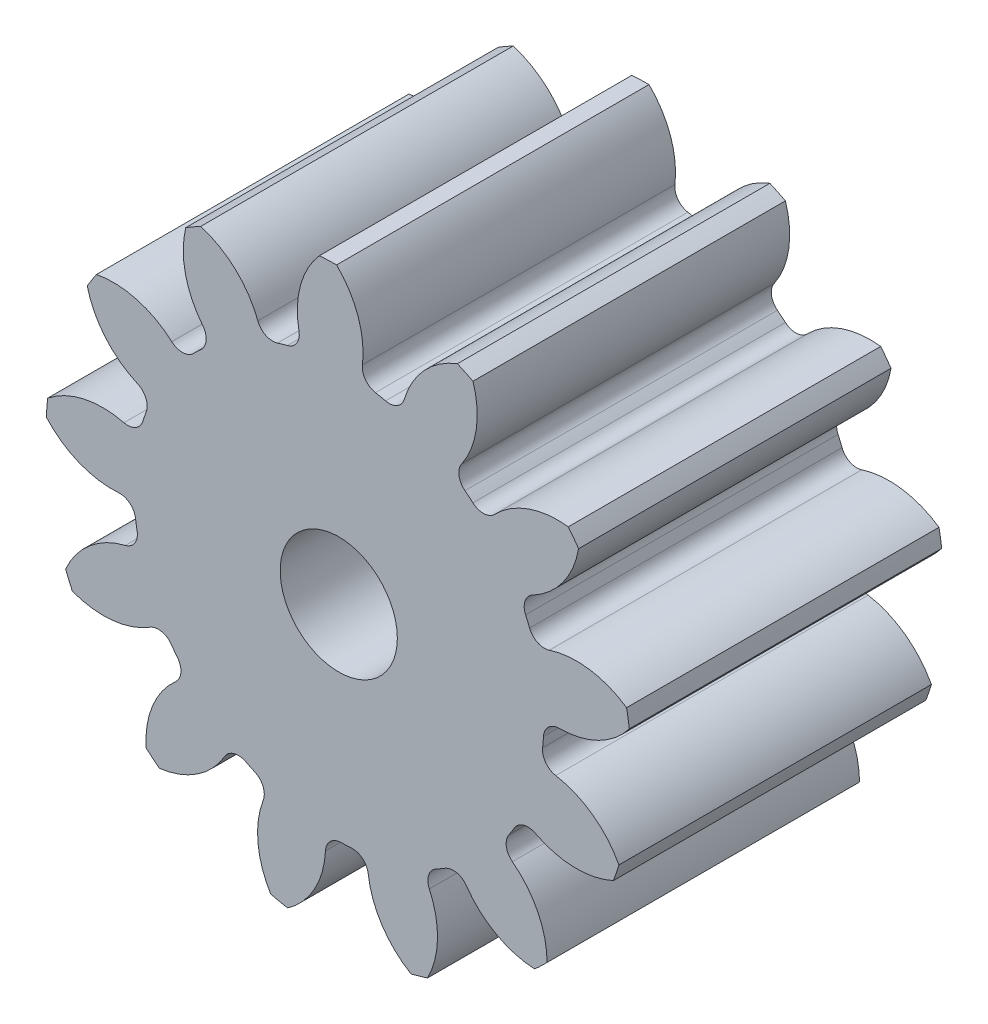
ISO-10303-21;
HEADER;
FILE_DESCRIPTION(('STEP AP214'),'2;1');
FILE_NAME('part.step','',(''),(''),'','','');
FILE_SCHEMA(('AUTOMOTIVE_DESIGN { 1 0 10303 214 1 1 1 1 }'));
ENDSEC;
DATA;
#1=APPLICATION_CONTEXT('core data for automotive mechanical design processes');
#2=APPLICATION_PROTOCOL_DEFINITION('international standard','automotive_design',2000,#1);
#3=PRODUCT_CONTEXT('',#1,'mechanical');
#4=PRODUCT('Part','Part','',(#3));
#5=PRODUCT_RELATED_PRODUCT_CATEGORY('part','',(#4));
#6=PRODUCT_DEFINITION_FORMATION('','',#4);
#7=PRODUCT_DEFINITION_CONTEXT('part definition',#1,'design');
#8=PRODUCT_DEFINITION('design','',#6,#7);
#9=PRODUCT_DEFINITION_SHAPE('','',#8);
#10=(LENGTH_UNIT() NAMED_UNIT(*) SI_UNIT(.MILLI.,.METRE.));
#11=(NAMED_UNIT(*) PLANE_ANGLE_UNIT() SI_UNIT($,.RADIAN.));
#12=(NAMED_UNIT(*) SI_UNIT($,.STERADIAN.) SOLID_ANGLE_UNIT());
#13=UNCERTAINTY_MEASURE_WITH_UNIT(LENGTH_MEASURE(1.E-05),#10,'distance_accuracy_value','');
#14=(GEOMETRIC_REPRESENTATION_CONTEXT(3) GLOBAL_UNCERTAINTY_ASSIGNED_CONTEXT((#13)) GLOBAL_UNIT_ASSIGNED_CONTEXT((#10,
#11,#12)) REPRESENTATION_CONTEXT('',''));
#15=CARTESIAN_POINT('',(0.,0.,0.));
#16=DIRECTION('',(0.,0.,1.));
#17=DIRECTION('',(1.,0.,0.));
#18=AXIS2_PLACEMENT_3D('',#15,#16,#17);
#19=CARTESIAN_POINT('',(0.,0.,101.6));
#20=DIRECTION('',(0.,0.,-1.));
#21=DIRECTION('',(-1.,0.,0.));
#22=AXIS2_PLACEMENT_3D('',#19,#20,#21);
#23=CYLINDRICAL_SURFACE('',#22,95.25);
#24=DIRECTION('',(0.,0.,-1.));
#25=VECTOR('',#24,1.);
#26=CARTESIAN_POINT('',(93.5882465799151,17.7144743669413,50.8));
#27=LINE('',#26,#25);
#28=CARTESIAN_POINT('',(93.5882465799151,17.7144743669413,101.6));
#29=VERTEX_POINT('',#28);
#30=CARTESIAN_POINT('',(93.5882465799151,17.7144743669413,0.));
#31=VERTEX_POINT('',#30);
#32=EDGE_CURVE('E564',#29,#31,#27,.T.);
#33=ORIENTED_EDGE('',*,*,#32,.F.);
#34=CARTESIAN_POINT('',(0.,0.,101.6));
#35=DIRECTION('',(0.,0.,1.));
#36=DIRECTION('',(1.,0.,0.));
#37=AXIS2_PLACEMENT_3D('',#34,#35,#36);
#38=CIRCLE('',#37,95.25);
#39=CARTESIAN_POINT('',(94.4676626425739,12.1829066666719,101.6));
#40=VERTEX_POINT('',#39);
#41=EDGE_CURVE('E1019',#40,#29,#38,.T.);
#42=ORIENTED_EDGE('',*,*,#41,.F.);
#43=DIRECTION('',(0.,0.,-1.));
#44=VECTOR('',#43,1.);
#45=CARTESIAN_POINT('',(94.4676626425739,12.1829066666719,50.8));
#46=LINE('',#45,#44);
#47=CARTESIAN_POINT('',(94.4676626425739,12.1829066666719,0.));
#48=VERTEX_POINT('',#47);
#49=EDGE_CURVE('E1013',#48,#40,#46,.F.);
#50=ORIENTED_EDGE('',*,*,#49,.F.);
#51=CARTESIAN_POINT('',(0.,0.,0.));
#52=DIRECTION('',(0.,0.,1.));
#53=DIRECTION('',(1.,0.,0.));
#54=AXIS2_PLACEMENT_3D('',#51,#52,#53);
#55=CIRCLE('',#54,95.25);
#56=EDGE_CURVE('E1024',#48,#31,#55,.T.);
#57=ORIENTED_EDGE('',*,*,#56,.T.);
#58=EDGE_LOOP('',(#33,#42,#50,#57));
#59=FACE_BOUND('',#58,.T.);
#60=ADVANCED_FACE('F33',(#59),#23,.T.);
#61=DIRECTION('',(0.,0.,-1.));
#62=VECTOR('',#61,1.);
#63=CARTESIAN_POINT('',(77.9852820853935,54.6887399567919,50.8));
#64=LINE('',#63,#62);
#65=CARTESIAN_POINT('',(77.9852820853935,54.6887399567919,0.));
#66=VERTEX_POINT('',#65);
#67=CARTESIAN_POINT('',(77.9852820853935,54.6887399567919,101.6));
#68=VERTEX_POINT('',#67);
#69=EDGE_CURVE('E535',#66,#68,#64,.F.);
#70=ORIENTED_EDGE('',*,*,#69,.F.);
#71=CARTESIAN_POINT('',(74.6359501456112,59.17801488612,0.));
#72=VERTEX_POINT('',#71);
#73=EDGE_CURVE('E1027',#66,#72,#55,.T.);
#74=ORIENTED_EDGE('',*,*,#73,.T.);
#75=DIRECTION('',(0.,0.,-1.));
#76=VECTOR('',#75,1.);
#77=CARTESIAN_POINT('',(74.6359501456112,59.17801488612,50.8));
#78=LINE('',#77,#76);
#79=CARTESIAN_POINT('',(74.6359501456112,59.17801488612,101.6));
#80=VERTEX_POINT('',#79);
#81=EDGE_CURVE('E597',#80,#72,#78,.T.);
#82=ORIENTED_EDGE('',*,*,#81,.F.);
#83=EDGE_CURVE('E1022',#68,#80,#38,.T.);
#84=ORIENTED_EDGE('',*,*,#83,.F.);
#85=EDGE_LOOP('',(#70,#74,#82,#84));
#86=FACE_BOUND('',#85,.T.);
#87=ADVANCED_FACE('F1176',(#86),#23,.T.);
#88=CARTESIAN_POINT('',(0.,0.,101.6));
#89=DIRECTION('',(0.,0.,1.));
#90=DIRECTION('',(1.,0.,0.));
#91=AXIS2_PLACEMENT_3D('',#88,#89,#90);
#92=PLANE('',#91);
#93=CARTESIAN_POINT('',(0.,0.,101.599999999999));
#94=DIRECTION('',(0.,0.,1.));
#95=DIRECTION('',(1.,0.,0.));
#96=AXIS2_PLACEMENT_3D('',#93,#94,#95);
#97=CIRCLE('',#96,19.05);
#98=CARTESIAN_POINT('',(19.05,0.,101.599999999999));
#99=VERTEX_POINT('',#98);
#100=EDGE_CURVE('E552',#99,#99,#97,.T.);
#101=ORIENTED_EDGE('',*,*,#100,.F.);
#102=EDGE_LOOP('',(#101));
#103=FACE_BOUND('',#102,.T.);
#104=ORIENTED_EDGE('',*,*,#41,.T.);
#105=CARTESIAN_POINT('',(77.3395332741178,-5.99614286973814,101.6));
#106=DIRECTION('',(0.,0.,-1.));
#107=DIRECTION('',(0.885456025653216,0.464723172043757,0.));
#108=AXIS2_PLACEMENT_3D('',#105,#106,#107);
#109=CIRCLE('',#108,28.7439394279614);
#110=CARTESIAN_POINT('',(68.4677193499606,21.3443942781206,101.6));
#111=VERTEX_POINT('',#110);
#112=EDGE_CURVE('E544',#111,#29,#109,.T.);
#113=ORIENTED_EDGE('',*,*,#112,.F.);
#114=CARTESIAN_POINT('',(66.8723389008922,26.2609264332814,101.6));
#115=DIRECTION('',(0.,0.,1.));
#116=DIRECTION('',(-0.885456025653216,-0.464723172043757,0.));
#117=AXIS2_PLACEMENT_3D('',#114,#115,#116);
#118=CIRCLE('',#117,5.16890000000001);
#119=CARTESIAN_POINT('',(62.0611241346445,24.3715509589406,101.6));
#120=VERTEX_POINT('',#119);
#121=EDGE_CURVE('E542',#120,#111,#118,.T.);
#122=ORIENTED_EDGE('',*,*,#121,.F.);
#123=CARTESIAN_POINT('',(0.,0.,101.6));
#124=DIRECTION('',(0.,0.,-1.));
#125=DIRECTION('',(0.885456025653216,0.464723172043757,0.));
#126=AXIS2_PLACEMENT_3D('',#123,#124,#125);
#127=CIRCLE('',#126,66.675);
#128=CARTESIAN_POINT('',(60.7587240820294,27.4578417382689,101.6));
#129=VERTEX_POINT('',#128);
#130=EDGE_CURVE('E527',#129,#120,#127,.T.);
#131=ORIENTED_EDGE('',*,*,#130,.F.);
#132=CARTESIAN_POINT('',(65.4689718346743,29.5864782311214,101.6));
#133=DIRECTION('',(0.,0.,1.));
#134=DIRECTION('',(-0.885456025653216,-0.464723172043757,0.));
#135=AXIS2_PLACEMENT_3D('',#132,#133,#134);
#136=CIRCLE('',#135,5.16890000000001);
#137=CARTESIAN_POINT('',(63.0597709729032,34.1595820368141,101.6));
#138=VERTEX_POINT('',#137);
#139=EDGE_CURVE('E519',#138,#129,#136,.T.);
#140=ORIENTED_EDGE('',*,*,#139,.F.);
#141=CARTESIAN_POINT('',(49.6623510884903,59.5903349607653,101.6));
#142=DIRECTION('',(0.,0.,-1.));
#143=DIRECTION('',(-0.885456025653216,-0.464723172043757,0.));
#144=AXIS2_PLACEMENT_3D('',#141,#142,#143);
#145=CIRCLE('',#144,28.7439394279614);
#146=EDGE_CURVE('E549',#68,#138,#145,.T.);
#147=ORIENTED_EDGE('',*,*,#146,.F.);
#148=ORIENTED_EDGE('',*,*,#83,.T.);
#149=CARTESIAN_POINT('',(71.2673022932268,30.6321523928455,101.6));
#150=DIRECTION('',(0.,0.,-1.));
#151=DIRECTION('',(0.568064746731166,0.822983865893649,0.));
#152=AXIS2_PLACEMENT_3D('',#149,#150,#151);
#153=CIRCLE('',#152,28.7439394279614);
#154=CARTESIAN_POINT('',(50.7059200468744,50.718058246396,101.6));
#155=VERTEX_POINT('',#154);
#156=EDGE_CURVE('E573',#155,#80,#153,.T.);
#157=ORIENTED_EDGE('',*,*,#156,.F.);
#158=CARTESIAN_POINT('',(47.008454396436,54.3300210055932,101.6));
#159=DIRECTION('',(0.,0.,1.));
#160=DIRECTION('',(-0.568064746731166,-0.822983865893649,0.));
#161=AXIS2_PLACEMENT_3D('',#158,#159,#160);
#162=CIRCLE('',#161,5.16890000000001);
#163=CARTESIAN_POINT('',(43.6263718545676,50.4211791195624,101.6));
#164=VERTEX_POINT('',#163);
#165=EDGE_CURVE('E571',#164,#155,#162,.T.);
#166=ORIENTED_EDGE('',*,*,#165,.F.);
#167=CARTESIAN_POINT('',(0.,0.,101.6));
#168=DIRECTION('',(0.,0.,-1.));
#169=DIRECTION('',(0.568064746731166,0.822983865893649,0.));
#170=AXIS2_PLACEMENT_3D('',#167,#168,#169);
#171=CIRCLE('',#170,66.675);
#172=CARTESIAN_POINT('',(41.0388830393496,52.5486984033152,101.6));
#173=VERTEX_POINT('',#172);
#174=EDGE_CURVE('E568',#173,#164,#171,.T.);
#175=ORIENTED_EDGE('',*,*,#174,.F.);
#176=CARTESIAN_POINT('',(44.220373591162,56.622473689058,101.6));
#177=DIRECTION('',(0.,0.,1.));
#178=DIRECTION('',(-0.568064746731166,-0.822983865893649,0.));
#179=AXIS2_PLACEMENT_3D('',#176,#177,#178);
#180=CIRCLE('',#179,5.16890000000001);
#181=CARTESIAN_POINT('',(39.9619048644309,59.5521445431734,101.6));
#182=VERTEX_POINT('',#181);
#183=EDGE_CURVE('E566',#182,#173,#180,.T.);
#184=ORIENTED_EDGE('',*,*,#183,.F.);
#185=CARTESIAN_POINT('',(16.2808185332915,75.8438664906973,101.6));
#186=DIRECTION('',(0.,0.,-1.));
#187=DIRECTION('',(-0.568064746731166,-0.822983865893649,0.));
#188=AXIS2_PLACEMENT_3D('',#185,#186,#187);
#189=CIRCLE('',#188,28.7439394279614);
#190=CARTESIAN_POINT('',(43.6374132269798,84.666041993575,101.6));
#191=VERTEX_POINT('',#190);
#192=EDGE_CURVE('E576',#191,#182,#189,.T.);
#193=ORIENTED_EDGE('',*,*,#192,.F.);
#194=CARTESIAN_POINT('',(38.5854569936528,87.0845853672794,101.6));
#195=VERTEX_POINT('',#194);
#196=EDGE_CURVE('E1061',#191,#195,#38,.T.);
#197=ORIENTED_EDGE('',*,*,#196,.T.);
#198=CARTESIAN_POINT('',(48.8685912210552,60.242990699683,101.6));
#199=DIRECTION('',(0.,0.,-1.));
#200=DIRECTION('',(0.120536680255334,0.992708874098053,0.));
#201=AXIS2_PLACEMENT_3D('',#198,#199,#200);
#202=CIRCLE('',#201,28.7439394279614);
#203=CARTESIAN_POINT('',(21.328005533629,68.472826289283,101.6));
#204=VERTEX_POINT('',#203);
#205=EDGE_CURVE('E608',#204,#195,#202,.T.);
#206=ORIENTED_EDGE('',*,*,#205,.F.);
#207=CARTESIAN_POINT('',(16.3754995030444,69.9527625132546,101.6));
#208=DIRECTION('',(0.,0.,1.));
#209=DIRECTION('',(-0.120536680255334,-0.992708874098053,0.));
#210=AXIS2_PLACEMENT_3D('',#207,#208,#209);
#211=CIRCLE('',#210,5.16890000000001);
#212=CARTESIAN_POINT('',(15.1973435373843,64.919922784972,101.6));
#213=VERTEX_POINT('',#212);
#214=EDGE_CURVE('E606',#213,#204,#211,.T.);
#215=ORIENTED_EDGE('',*,*,#214,.F.);
#216=CARTESIAN_POINT('',(0.,0.,101.6));
#217=DIRECTION('',(0.,0.,-1.));
#218=DIRECTION('',(0.120536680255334,0.992708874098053,0.));
#219=AXIS2_PLACEMENT_3D('',#216,#217,#218);
#220=CIRCLE('',#219,66.675);
#221=CARTESIAN_POINT('',(11.9175284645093,65.6012815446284,101.6));
#222=VERTEX_POINT('',#221);
#223=EDGE_CURVE('E603',#222,#213,#220,.T.);
#224=ORIENTED_EDGE('',*,*,#223,.F.);
#225=CARTESIAN_POINT('',(12.8414206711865,70.686942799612,101.6));
#226=DIRECTION('',(0.,0.,1.));
#227=DIRECTION('',(-0.120536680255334,-0.992708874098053,0.));
#228=AXIS2_PLACEMENT_3D('',#225,#226,#227);
#229=CIRCLE('',#228,5.16890000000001);
#230=CARTESIAN_POINT('',(7.70924794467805,71.3020284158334,101.6));
#231=VERTEX_POINT('',#230);
#232=EDGE_CURVE('E601',#231,#222,#229,.T.);
#233=ORIENTED_EDGE('',*,*,#232,.F.);
#234=CARTESIAN_POINT('',(-20.8304533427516,74.7224822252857,101.6));
#235=DIRECTION('',(0.,0.,-1.));
#236=DIRECTION('',(-0.120536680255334,-0.992708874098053,0.));
#237=AXIS2_PLACEMENT_3D('',#234,#235,#236);
#238=CIRCLE('',#237,28.7439394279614);
#239=CARTESIAN_POINT('',(-0.707261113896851,95.2473741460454,101.6));
#240=VERTEX_POINT('',#239);
#241=EDGE_CURVE('E611',#240,#231,#238,.T.);
#242=ORIENTED_EDGE('',*,*,#241,.F.);
#243=CARTESIAN_POINT('',(-6.30449935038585,95.0411268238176,101.6));
#244=VERTEX_POINT('',#243);
#245=EDGE_CURVE('E1158',#240,#244,#38,.T.);
#246=ORIENTED_EDGE('',*,*,#245,.T.);
#247=CARTESIAN_POINT('',(15.2746748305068,76.0528858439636,101.6));
#248=DIRECTION('',(0.,0.,-1.));
#249=DIRECTION('',(-0.354604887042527,0.935016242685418,0.));
#250=AXIS2_PLACEMENT_3D('',#247,#248,#249);
#251=CIRCLE('',#250,28.7439394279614);
#252=CARTESIAN_POINT('',(-12.9358980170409,70.5412950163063,101.6));
#253=VERTEX_POINT('',#252);
#254=EDGE_CURVE('E646',#253,#244,#251,.T.);
#255=ORIENTED_EDGE('',*,*,#254,.F.);
#256=CARTESIAN_POINT('',(-18.0088849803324,69.5501691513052,101.6));
#257=DIRECTION('',(0.,0.,1.));
#258=DIRECTION('',(0.354604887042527,-0.935016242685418,0.));
#259=AXIS2_PLACEMENT_3D('',#256,#257,#258);
#260=CIRCLE('',#259,5.16890000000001);
#261=CARTESIAN_POINT('',(-16.71321303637,64.5462945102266,101.6));
#262=VERTEX_POINT('',#261);
#263=EDGE_CURVE('E644',#262,#253,#260,.T.);
#264=ORIENTED_EDGE('',*,*,#263,.F.);
#265=CARTESIAN_POINT('',(0.,0.,101.6));
#266=DIRECTION('',(0.,0.,-1.));
#267=DIRECTION('',(-0.354604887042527,0.935016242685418,0.));
#268=AXIS2_PLACEMENT_3D('',#265,#266,#267);
#269=CIRCLE('',#268,66.675);
#270=CARTESIAN_POINT('',(-19.9339882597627,63.6254016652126,101.6));
#271=VERTEX_POINT('',#270);
#272=EDGE_CURVE('E641',#271,#262,#269,.T.);
#273=ORIENTED_EDGE('',*,*,#272,.F.);
#274=CARTESIAN_POINT('',(-21.4793469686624,68.5578851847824,101.6));
#275=DIRECTION('',(0.,0.,1.));
#276=DIRECTION('',(0.354604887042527,-0.935016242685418,0.));
#277=AXIS2_PLACEMENT_3D('',#274,#275,#276);
#278=CIRCLE('',#277,5.16890000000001);
#279=CARTESIAN_POINT('',(-26.3095047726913,66.7174768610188,101.6));
#280=VERTEX_POINT('',#279);
#281=EDGE_CURVE('E639',#280,#271,#278,.T.);
#282=ORIENTED_EDGE('',*,*,#281,.F.);
#283=CARTESIAN_POINT('',(-53.1697193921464,56.4830777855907,101.6));
#284=DIRECTION('',(0.,0.,-1.));
#285=DIRECTION('',(0.354604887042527,-0.935016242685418,0.));
#286=AXIS2_PLACEMENT_3D('',#283,#284,#285);
#287=CIRCLE('',#286,28.7439394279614);
#288=CARTESIAN_POINT('',(-44.8899104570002,84.0086807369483,101.6));
#289=VERTEX_POINT('',#288);
#290=EDGE_CURVE('E649',#289,#280,#287,.T.);
#291=ORIENTED_EDGE('',*,*,#290,.F.);
#292=CARTESIAN_POINT('',(-49.7501708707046,81.224891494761,101.6));
#293=VERTEX_POINT('',#292);
#294=EDGE_CURVE('E1154',#289,#293,#38,.T.);
#295=ORIENTED_EDGE('',*,*,#294,.T.);
#296=CARTESIAN_POINT('',(-21.8184854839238,74.4399813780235,101.6));
#297=DIRECTION('',(0.,0.,-1.));
#298=DIRECTION('',(-0.748510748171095,0.663122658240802,0.));
#299=AXIS2_PLACEMENT_3D('',#296,#297,#298);
#300=CIRCLE('',#299,28.7439394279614);
#301=CARTESIAN_POINT('',(-44.2363432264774,56.4496031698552,101.6));
#302=VERTEX_POINT('',#301);
#303=EDGE_CURVE('E684',#302,#293,#300,.T.);
#304=ORIENTED_EDGE('',*,*,#303,.F.);
#305=CARTESIAN_POINT('',(-48.2676509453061,53.2144702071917,101.6));
#306=DIRECTION('',(0.,0.,1.));
#307=DIRECTION('',(0.748510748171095,-0.663122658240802,0.));
#308=AXIS2_PLACEMENT_3D('',#305,#306,#307);
#309=CIRCLE('',#308,5.16890000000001);
#310=CARTESIAN_POINT('',(-44.7949739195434,49.3858880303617,101.6));
#311=VERTEX_POINT('',#310);
#312=EDGE_CURVE('E682',#311,#302,#309,.T.);
#313=ORIENTED_EDGE('',*,*,#312,.F.);
#314=CARTESIAN_POINT('',(0.,0.,101.6));
#315=DIRECTION('',(0.,0.,-1.));
#316=DIRECTION('',(-0.748510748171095,0.663122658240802,0.));
#317=AXIS2_PLACEMENT_3D('',#314,#315,#316);
#318=CIRCLE('',#317,66.675);
#319=CARTESIAN_POINT('',(-47.2188685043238,47.0737090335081,101.6));
#320=VERTEX_POINT('',#319);
#321=EDGE_CURVE('E679',#320,#311,#318,.T.);
#322=ORIENTED_EDGE('',*,*,#321,.F.);
#323=CARTESIAN_POINT('',(-50.8794550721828,50.723042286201,101.6));
#324=DIRECTION('',(0.,0.,1.));
#325=DIRECTION('',(0.748510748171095,-0.663122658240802,0.));
#326=AXIS2_PLACEMENT_3D('',#323,#324,#325);
#327=CIRCLE('',#326,5.16890000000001);
#328=CARTESIAN_POINT('',(-54.3010670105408,46.8487553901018,101.6));
#329=VERTEX_POINT('',#328);
#330=EDGE_CURVE('E677',#329,#320,#327,.T.);
#331=ORIENTED_EDGE('',*,*,#330,.F.);
#332=CARTESIAN_POINT('',(-73.328443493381,25.3040809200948,101.6));
#333=DIRECTION('',(0.,0.,-1.));
#334=DIRECTION('',(0.748510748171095,-0.663122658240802,0.));
#335=AXIS2_PLACEMENT_3D('',#332,#333,#334);
#336=CIRCLE('',#335,28.7439394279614);
#337=CARTESIAN_POINT('',(-78.7888222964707,53.5246109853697,101.6));
#338=VERTEX_POINT('',#337);
#339=EDGE_CURVE('E687',#338,#329,#336,.T.);
#340=ORIENTED_EDGE('',*,*,#339,.F.);
#341=CARTESIAN_POINT('',(-81.7986777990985,48.8010123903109,101.6));
#342=VERTEX_POINT('',#341);
#343=EDGE_CURVE('E1150',#338,#342,#38,.T.);
#344=ORIENTED_EDGE('',*,*,#343,.T.);
#345=CARTESIAN_POINT('',(-53.9132937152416,55.7737742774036,101.6));
#346=DIRECTION('',(0.,0.,-1.));
#347=DIRECTION('',(-0.97094181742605,0.239315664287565,0.));
#348=AXIS2_PLACEMENT_3D('',#345,#346,#347);
#349=CIRCLE('',#348,28.7439394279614);
#350=CARTESIAN_POINT('',(-65.4027753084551,29.4259875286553,101.6));
#351=VERTEX_POINT('',#350);
#352=EDGE_CURVE('E722',#351,#342,#349,.T.);
#353=ORIENTED_EDGE('',*,*,#352,.F.);
#354=CARTESIAN_POINT('',(-67.4688797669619,24.6879774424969,101.6));
#355=DIRECTION('',(0.,0.,1.));
#356=DIRECTION('',(0.97094181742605,-0.239315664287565,0.));
#357=AXIS2_PLACEMENT_3D('',#354,#355,#356);
#358=CIRCLE('',#357,5.16890000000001);
#359=CARTESIAN_POINT('',(-62.6147461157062,22.9117697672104,101.6));
#360=VERTEX_POINT('',#359);
#361=EDGE_CURVE('E720',#360,#351,#358,.T.);
#362=ORIENTED_EDGE('',*,*,#361,.F.);
#363=CARTESIAN_POINT('',(0.,0.,101.6));
#364=DIRECTION('',(0.,0.,-1.));
#365=DIRECTION('',(-0.97094181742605,0.239315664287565,0.));
#366=AXIS2_PLACEMENT_3D('',#363,#364,#365);
#367=CIRCLE('',#366,66.675);
#368=CARTESIAN_POINT('',(-63.6864750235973,19.7379969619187,101.6));
#369=VERTEX_POINT('',#368);
#370=EDGE_CURVE('E717',#369,#360,#367,.T.);
#371=ORIENTED_EDGE('',*,*,#370,.F.);
#372=CARTESIAN_POINT('',(-68.6236931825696,21.268161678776,101.6));
#373=DIRECTION('',(0.,0.,1.));
#374=DIRECTION('',(0.97094181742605,-0.239315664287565,0.));
#375=AXIS2_PLACEMENT_3D('',#372,#373,#374);
#376=CIRCLE('',#375,5.16890000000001);
#377=CARTESIAN_POINT('',(-69.8529091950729,16.2475486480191,101.6));
#378=VERTEX_POINT('',#377);
#379=EDGE_CURVE('E715',#378,#369,#376,.T.);
#380=ORIENTED_EDGE('',*,*,#379,.F.);
#381=CARTESIAN_POINT('',(-76.6885048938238,-11.671775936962,101.6));
#382=DIRECTION('',(0.,0.,-1.));
#383=DIRECTION('',(0.97094181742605,-0.239315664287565,0.));
#384=AXIS2_PLACEMENT_3D('',#381,#382,#383);
#385=CIRCLE('',#384,28.7439394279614);
#386=CARTESIAN_POINT('',(-94.6381644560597,10.7786978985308,101.6));
#387=VERTEX_POINT('',#386);
#388=EDGE_CURVE('E725',#387,#378,#385,.T.);
#389=ORIENTED_EDGE('',*,*,#388,.F.);
#390=CARTESIAN_POINT('',(-95.1080934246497,5.19740946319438,101.6));
#391=VERTEX_POINT('',#390);
#392=EDGE_CURVE('E1146',#387,#391,#38,.T.);
#393=ORIENTED_EDGE('',*,*,#392,.T.);
#394=CARTESIAN_POINT('',(-73.6572160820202,24.3304676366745,101.6));
#395=DIRECTION('',(0.,0.,-1.));
#396=DIRECTION('',(-0.970941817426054,-0.239315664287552,0.));
#397=AXIS2_PLACEMENT_3D('',#394,#395,#396);
#398=CIRCLE('',#397,28.7439394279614);
#399=CARTESIAN_POINT('',(-71.5862197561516,-4.33876723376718,101.6));
#400=VERTEX_POINT('',#399);
#401=EDGE_CURVE('E760',#400,#391,#398,.T.);
#402=ORIENTED_EDGE('',*,*,#401,.F.);
#403=CARTESIAN_POINT('',(-71.2138013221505,-9.49423343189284,101.6));
#404=DIRECTION('',(0.,0.,1.));
#405=DIRECTION('',(0.970941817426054,0.239315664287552,0.));
#406=AXIS2_PLACEMENT_3D('',#403,#404,#405);
#407=CIRCLE('',#406,5.16890000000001);
#408=CARTESIAN_POINT('',(-66.0902345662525,-8.81115883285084,101.6));
#409=VERTEX_POINT('',#408);
#410=EDGE_CURVE('E758',#409,#400,#407,.T.);
#411=ORIENTED_EDGE('',*,*,#410,.F.);
#412=CARTESIAN_POINT('',(0.,0.,101.6));
#413=DIRECTION('',(0.,0.,-1.));
#414=DIRECTION('',(-0.970941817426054,-0.239315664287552,0.));
#415=AXIS2_PLACEMENT_3D('',#412,#413,#414);
#416=CIRCLE('',#415,66.675);
#417=CARTESIAN_POINT('',(-65.56427762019,-12.1194523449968,101.6));
#418=VERTEX_POINT('',#417);
#419=EDGE_CURVE('E755',#418,#409,#416,.T.);
#420=ORIENTED_EDGE('',*,*,#419,.F.);
#421=CARTESIAN_POINT('',(-70.6470701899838,-13.0589984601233,101.6));
#422=DIRECTION('',(0.,0.,1.));
#423=DIRECTION('',(0.970941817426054,0.239315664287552,0.));
#424=AXIS2_PLACEMENT_3D('',#421,#422,#423);
#425=CIRCLE('',#424,5.16890000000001);
#426=CARTESIAN_POINT('',(-69.4022917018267,-18.0757756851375,101.6));
#427=VERTEX_POINT('',#426);
#428=EDGE_CURVE('E753',#427,#418,#425,.T.);
#429=ORIENTED_EDGE('',*,*,#428,.F.);
#430=CARTESIAN_POINT('',(-62.4801540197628,-45.9737695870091,101.6));
#431=DIRECTION('',(0.,0.,-1.));
#432=DIRECTION('',(0.970941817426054,0.239315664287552,0.));
#433=AXIS2_PLACEMENT_3D('',#430,#431,#432);
#434=CIRCLE('',#433,28.7439394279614);
#435=CARTESIAN_POINT('',(-88.8070436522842,-34.4364849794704,101.6));
#436=VERTEX_POINT('',#435);
#437=EDGE_CURVE('E763',#436,#427,#434,.T.);
#438=ORIENTED_EDGE('',*,*,#437,.F.);
#439=CARTESIAN_POINT('',(-86.6293910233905,-39.5968573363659,101.6));
#440=VERTEX_POINT('',#439);
#441=EDGE_CURVE('E1142',#436,#440,#38,.T.);
#442=ORIENTED_EDGE('',*,*,#441,.T.);
#443=CARTESIAN_POINT('',(-76.5271579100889,-12.6866559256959,101.6));
#444=DIRECTION('',(0.,0.,-1.));
#445=DIRECTION('',(-0.748510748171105,-0.663122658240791,0.));
#446=AXIS2_PLACEMENT_3D('',#443,#444,#445);
#447=CIRCLE('',#446,28.7439394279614);
#448=CARTESIAN_POINT('',(-61.3701239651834,-37.109562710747,101.6));
#449=VERTEX_POINT('',#448);
#450=EDGE_CURVE('E798',#449,#440,#447,.T.);
#451=ORIENTED_EDGE('',*,*,#450,.F.);
#452=CARTESIAN_POINT('',(-58.6444992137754,-41.5014298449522,101.6));
#453=DIRECTION('',(0.,0.,1.));
#454=DIRECTION('',(0.748510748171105,0.663122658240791,0.));
#455=AXIS2_PLACEMENT_3D('',#452,#453,#454);
#456=CIRCLE('',#455,5.16890000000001);
#457=CARTESIAN_POINT('',(-54.4252467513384,-38.5155571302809,101.6));
#458=VERTEX_POINT('',#457);
#459=EDGE_CURVE('E796',#458,#449,#456,.T.);
#460=ORIENTED_EDGE('',*,*,#459,.F.);
#461=CARTESIAN_POINT('',(0.,0.,101.6));
#462=DIRECTION('',(0.,0.,-1.));
#463=DIRECTION('',(-0.748510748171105,-0.663122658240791,0.));
#464=AXIS2_PLACEMENT_3D('',#461,#462,#463);
#465=CIRCLE('',#464,66.675);
#466=CARTESIAN_POINT('',(-52.4220943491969,-41.2004811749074,101.6));
#467=VERTEX_POINT('',#466);
#468=EDGE_CURVE('E793',#467,#458,#465,.T.);
#469=ORIENTED_EDGE('',*,*,#468,.F.);
#470=CARTESIAN_POINT('',(-56.4860548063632,-44.3944994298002,101.6));
#471=DIRECTION('',(0.,0.,1.));
#472=DIRECTION('',(0.748510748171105,0.663122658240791,0.));
#473=AXIS2_PLACEMENT_3D('',#470,#471,#472);
#474=CIRCLE('',#473,5.16890000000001);
#475=CARTESIAN_POINT('',(-53.0524455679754,-48.2581576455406,101.6));
#476=VERTEX_POINT('',#475);
#477=EDGE_CURVE('E791',#476,#467,#474,.T.);
#478=ORIENTED_EDGE('',*,*,#477,.F.);
#479=CARTESIAN_POINT('',(-33.9583528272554,-69.7437266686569,101.6));
#480=DIRECTION('',(0.,0.,-1.));
#481=DIRECTION('',(0.748510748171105,0.663122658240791,0.));
#482=AXIS2_PLACEMENT_3D('',#479,#480,#481);
#483=CIRCLE('',#482,28.7439394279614);
#484=CARTESIAN_POINT('',(-62.6312993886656,-71.7626841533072,101.6));
#485=VERTEX_POINT('',#484);
#486=EDGE_CURVE('E801',#485,#476,#483,.T.);
#487=ORIENTED_EDGE('',*,*,#486,.F.);
#488=CARTESIAN_POINT('',(-58.3049391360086,-75.3199613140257,101.6));
#489=VERTEX_POINT('',#488);
#490=EDGE_CURVE('E1138',#485,#489,#38,.T.);
#491=ORIENTED_EDGE('',*,*,#490,.T.);
#492=CARTESIAN_POINT('',(-61.8656501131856,-46.7974195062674,101.6));
#493=DIRECTION('',(0.,0.,-1.));
#494=DIRECTION('',(-0.35460488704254,-0.935016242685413,0.));
#495=AXIS2_PLACEMENT_3D('',#492,#493,#494);
#496=CIRCLE('',#495,28.7439394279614);
#497=CARTESIAN_POINT('',(-37.0948723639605,-61.3790045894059,101.6));
#498=VERTEX_POINT('',#497);
#499=EDGE_CURVE('E836',#498,#489,#496,.T.);
#500=ORIENTED_EDGE('',*,*,#499,.F.);
#501=CARTESIAN_POINT('',(-32.6404490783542,-64.001148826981,101.6));
#502=DIRECTION('',(0.,0.,1.));
#503=DIRECTION('',(0.35460488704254,0.935016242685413,0.));
#504=AXIS2_PLACEMENT_3D('',#501,#502,#503);
#505=CIRCLE('',#504,5.16890000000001);
#506=CARTESIAN_POINT('',(-30.2920908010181,-59.3965054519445,101.6));
#507=VERTEX_POINT('',#506);
#508=EDGE_CURVE('E834',#507,#498,#505,.T.);
#509=ORIENTED_EDGE('',*,*,#508,.F.);
#510=CARTESIAN_POINT('',(0.,0.,101.6));
#511=DIRECTION('',(0.,0.,-1.));
#512=DIRECTION('',(-0.35460488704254,-0.935016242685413,0.));
#513=AXIS2_PLACEMENT_3D('',#510,#511,#512);
#514=CIRCLE('',#513,66.675);
#515=CARTESIAN_POINT('',(-27.2706410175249,-60.8429762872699,101.6));
#516=VERTEX_POINT('',#515);
#517=EDGE_CURVE('E831',#516,#507,#514,.T.);
#518=ORIENTED_EDGE('',*,*,#517,.F.);
#519=CARTESIAN_POINT('',(-29.3847649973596,-65.5597555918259,101.6));
#520=DIRECTION('',(0.,0.,1.));
#521=DIRECTION('',(0.35460488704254,0.935016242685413,0.));
#522=AXIS2_PLACEMENT_3D('',#519,#520,#521);
#523=CIRCLE('',#522,5.16890000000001);
#524=CARTESIAN_POINT('',(-24.5489235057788,-67.3851772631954,101.6));
#525=VERTEX_POINT('',#524);
#526=EDGE_CURVE('E829',#525,#516,#523,.T.);
#527=ORIENTED_EDGE('',*,*,#526,.F.);
#528=CARTESIAN_POINT('',(2.34289775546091,-77.5362364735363,101.6));
#529=DIRECTION('',(0.,0.,-1.));
#530=DIRECTION('',(0.35460488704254,0.935016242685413,0.));
#531=AXIS2_PLACEMENT_3D('',#528,#529,#530);
#532=CIRCLE('',#531,28.7439394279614);
#533=CARTESIAN_POINT('',(-22.107479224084,-92.6489172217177,101.6));
#534=VERTEX_POINT('',#533);
#535=EDGE_CURVE('E839',#534,#525,#532,.T.);
#536=ORIENTED_EDGE('',*,*,#535,.F.);
#537=CARTESIAN_POINT('',(-16.6235283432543,-93.7881698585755,101.6));
#538=VERTEX_POINT('',#537);
#539=EDGE_CURVE('E1134',#534,#538,#38,.T.);
#540=ORIENTED_EDGE('',*,*,#539,.T.);
#541=CARTESIAN_POINT('',(-33.0314674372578,-70.1874582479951,101.6));
#542=DIRECTION('',(0.,0.,-1.));
#543=DIRECTION('',(0.12053668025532,-0.992708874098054,0.));
#544=AXIS2_PLACEMENT_3D('',#541,#542,#543);
#545=CIRCLE('',#544,28.7439394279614);
#546=CARTESIAN_POINT('',(-4.32163254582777,-71.587256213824,101.6));
#547=VERTEX_POINT('',#546);
#548=EDGE_CURVE('E874',#547,#538,#545,.T.);
#549=ORIENTED_EDGE('',*,*,#548,.F.);
#550=CARTESIAN_POINT('',(0.841134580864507,-71.838975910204,101.6));
#551=DIRECTION('',(0.,0.,1.));
#552=DIRECTION('',(-0.12053668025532,0.992708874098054,0.));
#553=AXIS2_PLACEMENT_3D('',#550,#551,#552);
#554=CIRCLE('',#553,5.16890000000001);
#555=CARTESIAN_POINT('',(0.780618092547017,-66.670430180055,101.6));
#556=VERTEX_POINT('',#555);
#557=EDGE_CURVE('E872',#556,#547,#554,.T.);
#558=ORIENTED_EDGE('',*,*,#557,.F.);
#559=CARTESIAN_POINT('',(0.,0.,101.6));
#560=DIRECTION('',(0.,0.,-1.));
#561=DIRECTION('',(0.12053668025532,-0.992708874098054,0.));
#562=AXIS2_PLACEMENT_3D('',#559,#560,#561);
#563=CIRCLE('',#562,66.675);
#564=CARTESIAN_POINT('',(4.12818752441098,-66.5470787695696,101.6));
#565=VERTEX_POINT('',#564);
#566=EDGE_CURVE('E869',#565,#556,#563,.T.);
#567=ORIENTED_EDGE('',*,*,#566,.F.);
#568=CARTESIAN_POINT('',(4.44822034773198,-71.7060618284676,101.6));
#569=DIRECTION('',(0.,0.,1.));
#570=DIRECTION('',(-0.12053668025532,0.992708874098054,0.));
#571=AXIS2_PLACEMENT_3D('',#568,#569,#570);
#572=CIRCLE('',#571,5.16890000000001);
#573=CARTESIAN_POINT('',(9.57846108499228,-71.0750648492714,101.6));
#574=VERTEX_POINT('',#573);
#575=EDGE_CURVE('E867',#574,#565,#572,.T.);
#576=ORIENTED_EDGE('',*,*,#575,.F.);
#577=CARTESIAN_POINT('',(38.1074186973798,-67.5661289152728,101.6));
#578=DIRECTION('',(0.,0.,-1.));
#579=DIRECTION('',(-0.12053668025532,0.992708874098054,0.));
#580=AXIS2_PLACEMENT_3D('',#577,#578,#579);
#581=CIRCLE('',#580,28.7439394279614);
#582=CARTESIAN_POINT('',(23.4808980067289,-92.3103998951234,101.6));
#583=VERTEX_POINT('',#582);
#584=EDGE_CURVE('E877',#583,#574,#581,.T.);
#585=ORIENTED_EDGE('',*,*,#584,.F.);
#586=CARTESIAN_POINT('',(28.8661324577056,-90.7706389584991,101.6));
#587=VERTEX_POINT('',#586);
#588=EDGE_CURVE('E1130',#583,#587,#38,.T.);
#589=ORIENTED_EDGE('',*,*,#588,.T.);
#590=CARTESIAN_POINT('',(3.36982635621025,-77.4983961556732,101.6));
#591=DIRECTION('',(0.,0.,-1.));
#592=DIRECTION('',(0.568064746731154,-0.822983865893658,0.));
#593=AXIS2_PLACEMENT_3D('',#590,#591,#592);
#594=CIRCLE('',#593,28.7439394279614);
#595=CARTESIAN_POINT('',(29.4416412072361,-65.3957301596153,101.6));
#596=VERTEX_POINT('',#595);
#597=EDGE_CURVE('E912',#596,#587,#594,.T.);
#598=ORIENTED_EDGE('',*,*,#597,.F.);
#599=CARTESIAN_POINT('',(34.1300244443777,-63.2193593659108,101.6));
#600=DIRECTION('',(0.,0.,1.));
#601=DIRECTION('',(-0.568064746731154,0.822983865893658,0.));
#602=AXIS2_PLACEMENT_3D('',#599,#600,#601);
#603=CIRCLE('',#602,5.16890000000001);
#604=CARTESIAN_POINT('',(31.6744967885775,-58.6709628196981,101.6));
#605=VERTEX_POINT('',#604);
#606=EDGE_CURVE('E910',#605,#596,#603,.T.);
#607=ORIENTED_EDGE('',*,*,#606,.F.);
#608=CARTESIAN_POINT('',(0.,0.,101.6));
#609=DIRECTION('',(0.,0.,-1.));
#610=DIRECTION('',(0.568064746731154,-0.822983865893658,0.));
#611=AXIS2_PLACEMENT_3D('',#608,#609,#610);
#612=CIRCLE('',#611,66.675);
#613=CARTESIAN_POINT('',(34.5812980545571,-57.0060474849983,101.6));
#614=VERTEX_POINT('',#613);
#615=EDGE_CURVE('E907',#614,#605,#612,.T.);
#616=ORIENTED_EDGE('',*,*,#615,.F.);
#617=CARTESIAN_POINT('',(37.2621720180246,-61.4253734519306,101.6));
#618=DIRECTION('',(0.,0.,1.));
#619=DIRECTION('',(-0.568064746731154,0.822983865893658,0.));
#620=AXIS2_PLACEMENT_3D('',#617,#618,#619);
#621=CIRCLE('',#620,5.16890000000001);
#622=CARTESIAN_POINT('',(41.5115356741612,-58.4825116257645,101.6));
#623=VERTEX_POINT('',#622);
#624=EDGE_CURVE('E905',#623,#614,#621,.T.);
#625=ORIENTED_EDGE('',*,*,#624,.F.);
#626=CARTESIAN_POINT('',(65.1419892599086,-42.1174354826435,101.6));
#627=DIRECTION('',(0.,0.,-1.));
#628=DIRECTION('',(-0.568064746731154,0.822983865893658,0.));
#629=AXIS2_PLACEMENT_3D('',#626,#627,#628);
#630=CIRCLE('',#629,28.7439394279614);
#631=CARTESIAN_POINT('',(63.6900844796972,-70.8246824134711,101.6));
#632=VERTEX_POINT('',#631);
#633=EDGE_CURVE('E915',#632,#623,#630,.T.);
#634=ORIENTED_EDGE('',*,*,#633,.F.);
#635=CARTESIAN_POINT('',(67.7429101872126,-66.9586485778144,101.6));
#636=VERTEX_POINT('',#635);
#637=EDGE_CURVE('E1129',#632,#636,#38,.T.);
#638=ORIENTED_EDGE('',*,*,#637,.T.);
#639=CARTESIAN_POINT('',(38.9991335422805,-67.0553854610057,101.6));
#640=DIRECTION('',(0.,0.,-1.));
#641=DIRECTION('',(0.885456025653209,-0.46472317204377,0.));
#642=AXIS2_PLACEMENT_3D('',#639,#640,#641);
#643=CIRCLE('',#642,28.7439394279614);
#644=CARTESIAN_POINT('',(56.4601897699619,-44.2228304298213,101.6));
#645=VERTEX_POINT('',#644);
#646=EDGE_CURVE('E950',#645,#636,#643,.T.);
#647=ORIENTED_EDGE('',*,*,#646,.F.);
#648=CARTESIAN_POINT('',(59.6001370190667,-40.1169494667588,101.6));
#649=DIRECTION('',(0.,0.,1.));
#650=DIRECTION('',(-0.885456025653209,0.46472317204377,0.));
#651=AXIS2_PLACEMENT_3D('',#648,#649,#650);
#652=CIRCLE('',#651,5.16890000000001);
#653=CARTESIAN_POINT('',(55.3121299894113,-37.2306849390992,101.6));
#654=VERTEX_POINT('',#653);
#655=EDGE_CURVE('E948',#654,#645,#652,.T.);
#656=ORIENTED_EDGE('',*,*,#655,.F.);
#657=CARTESIAN_POINT('',(0.,0.,101.6));
#658=DIRECTION('',(0.,0.,-1.));
#659=DIRECTION('',(0.885456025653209,-0.46472317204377,0.));
#660=AXIS2_PLACEMENT_3D('',#657,#658,#659);
#661=CIRCLE('',#660,66.675);
#662=CARTESIAN_POINT('',(57.1122499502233,-34.40561771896,101.6));
#663=VERTEX_POINT('',#662);
#664=EDGE_CURVE('E945',#663,#654,#661,.T.);
#665=ORIENTED_EDGE('',*,*,#664,.F.);
#666=CARTESIAN_POINT('',(61.5398091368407,-37.0728722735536,101.6));
#667=DIRECTION('',(0.,0.,1.));
#668=DIRECTION('',(-0.885456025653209,0.46472317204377,0.));
#669=AXIS2_PLACEMENT_3D('',#666,#667,#668);
#670=CIRCLE('',#669,5.16890000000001);
#671=CARTESIAN_POINT('',(63.9348177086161,-32.4923197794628,101.6));
#672=VERTEX_POINT('',#671);
#673=EDGE_CURVE('E943',#672,#663,#670,.T.);
#674=ORIENTED_EDGE('',*,*,#673,.F.);
#675=CARTESIAN_POINT('',(77.2533151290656,-7.02014515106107,101.6));
#676=DIRECTION('',(0.,0.,-1.));
#677=DIRECTION('',(-0.885456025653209,0.46472317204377,0.));
#678=AXIS2_PLACEMENT_3D('',#675,#676,#677);
#679=CIRCLE('',#678,28.7439394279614);
#680=CARTESIAN_POINT('',(89.3086401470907,-33.1138837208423,101.6));
#681=VERTEX_POINT('',#680);
#682=EDGE_CURVE('E953',#681,#672,#679,.T.);
#683=ORIENTED_EDGE('',*,*,#682,.F.);
#684=CARTESIAN_POINT('',(91.1006035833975,-27.8072387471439,101.6));
#685=VERTEX_POINT('',#684);
#686=EDGE_CURVE('E1023',#681,#685,#38,.T.);
#687=ORIENTED_EDGE('',*,*,#686,.T.);
#688=CARTESIAN_POINT('',(65.6942092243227,-41.2507940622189,101.6));
#689=DIRECTION('',(0.,0.,-1.));
#690=DIRECTION('',(1.,0.,0.));
#691=AXIS2_PLACEMENT_3D('',#688,#689,#690);
#692=CIRCLE('',#691,28.7439394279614);
#693=CARTESIAN_POINT('',(70.5443892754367,-12.9190131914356,101.6));
#694=VERTEX_POINT('',#693);
#695=EDGE_CURVE('E988',#694,#685,#692,.T.);
#696=ORIENTED_EDGE('',*,*,#695,.F.);
#697=CARTESIAN_POINT('',(71.4165764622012,-7.82422990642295,101.6));
#698=DIRECTION('',(0.,0.,1.));
#699=DIRECTION('',(-1.,0.,0.));
#700=AXIS2_PLACEMENT_3D('',#697,#698,#699);
#701=CIRCLE('',#700,5.16890000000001);
#702=CARTESIAN_POINT('',(66.2784207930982,-7.261305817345,101.6));
#703=VERTEX_POINT('',#702);
#704=EDGE_CURVE('E986',#703,#694,#701,.T.);
#705=ORIENTED_EDGE('',*,*,#704,.F.);
#706=CARTESIAN_POINT('',(0.,0.,101.6));
#707=DIRECTION('',(0.,0.,-1.));
#708=DIRECTION('',(1.,0.,0.));
#709=AXIS2_PLACEMENT_3D('',#706,#707,#708);
#710=CIRCLE('',#709,66.675);
#711=CARTESIAN_POINT('',(66.5594736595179,-3.92327556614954,101.6));
#712=VERTEX_POINT('',#711);
#713=EDGE_CURVE('E983',#712,#703,#710,.T.);
#714=ORIENTED_EDGE('',*,*,#713,.F.);
#715=CARTESIAN_POINT('',(71.7194176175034,-4.22742283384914,101.6));
#716=DIRECTION('',(0.,0.,1.));
#717=DIRECTION('',(-1.,0.,0.));
#718=AXIS2_PLACEMENT_3D('',#715,#716,#717);
#719=CIRCLE('',#718,5.16890000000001);
#720=CARTESIAN_POINT('',(71.7114035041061,0.941470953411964,101.6));
#721=VERTEX_POINT('',#720);
#722=EDGE_CURVE('E981',#721,#712,#719,.T.);
#723=ORIENTED_EDGE('',*,*,#722,.F.);
#724=CARTESIAN_POINT('',(71.6668375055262,29.6853758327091,101.6));
#725=DIRECTION('',(0.,0.,-1.));
#726=DIRECTION('',(-1.,0.,0.));
#727=AXIS2_PLACEMENT_3D('',#724,#725,#726);
#728=CIRCLE('',#727,28.7439394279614);
#729=EDGE_CURVE('E991',#40,#721,#728,.T.);
#730=ORIENTED_EDGE('',*,*,#729,.F.);
#731=EDGE_LOOP('',(#104,#113,#122,#131,#140,#147,#148,#157,#166,#175,#184,#193,#197,#206,#215,
#224,#233,#242,#246,#255,#264,#273,#282,#291,#295,#304,#313,#322,#331,#340,#344,#353,#362,#371,
#380,#389,#393,#402,#411,#420,#429,#438,#442,#451,#460,#469,#478,#487,#491,#500,#509,#518,#527,
#536,#540,#549,#558,#567,#576,#585,#589,#598,#607,#616,#625,#634,#638,#647,#656,#665,#674,#683,
#687,#696,#705,#714,#723,#730));
#732=FACE_BOUND('',#731,.T.);
#733=ADVANCED_FACE('F540',(#103,#732),#92,.T.);
#734=CARTESIAN_POINT('',(0.,0.,0.));
#735=DIRECTION('',(0.,0.,1.));
#736=DIRECTION('',(1.,0.,0.));
#737=AXIS2_PLACEMENT_3D('',#734,#735,#736);
#738=PLANE('',#737);
#739=CARTESIAN_POINT('',(0.,0.,0.));
#740=DIRECTION('',(0.,0.,1.));
#741=DIRECTION('',(1.,0.,0.));
#742=AXIS2_PLACEMENT_3D('',#739,#740,#741);
#743=CIRCLE('',#742,19.05);
#744=CARTESIAN_POINT('',(19.05,0.,-1.77635683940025E-12));
#745=VERTEX_POINT('',#744);
#746=EDGE_CURVE('E36',#745,#745,#743,.T.);
#747=ORIENTED_EDGE('',*,*,#746,.T.);
#748=EDGE_LOOP('',(#747));
#749=FACE_BOUND('',#748,.T.);
#750=CARTESIAN_POINT('',(77.3395332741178,-5.99614286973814,0.));
#751=DIRECTION('',(0.,0.,-1.));
#752=DIRECTION('',(0.885456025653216,0.464723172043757,0.));
#753=AXIS2_PLACEMENT_3D('',#750,#751,#752);
#754=CIRCLE('',#753,28.7439394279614);
#755=CARTESIAN_POINT('',(68.4677193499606,21.3443942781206,0.));
#756=VERTEX_POINT('',#755);
#757=EDGE_CURVE('E528',#756,#31,#754,.T.);
#758=ORIENTED_EDGE('',*,*,#757,.T.);
#759=ORIENTED_EDGE('',*,*,#56,.F.);
#760=CARTESIAN_POINT('',(71.6668375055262,29.6853758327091,0.));
#761=DIRECTION('',(0.,0.,1.));
#762=DIRECTION('',(1.,0.,0.));
#763=AXIS2_PLACEMENT_3D('',#760,#761,#762);
#764=CIRCLE('',#763,28.7439394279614);
#765=CARTESIAN_POINT('',(71.7114035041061,0.941470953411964,0.));
#766=VERTEX_POINT('',#765);
#767=EDGE_CURVE('E1021',#766,#48,#764,.T.);
#768=ORIENTED_EDGE('',*,*,#767,.F.);
#769=CARTESIAN_POINT('',(71.7194176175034,-4.22742283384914,0.));
#770=DIRECTION('',(0.,0.,1.));
#771=DIRECTION('',(-1.,0.,0.));
#772=AXIS2_PLACEMENT_3D('',#769,#770,#771);
#773=CIRCLE('',#772,5.16890000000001);
#774=CARTESIAN_POINT('',(66.5594736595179,-3.92327556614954,0.));
#775=VERTEX_POINT('',#774);
#776=EDGE_CURVE('E980',#766,#775,#773,.T.);
#777=ORIENTED_EDGE('',*,*,#776,.T.);
#778=CARTESIAN_POINT('',(0.,0.,0.));
#779=DIRECTION('',(0.,0.,-1.));
#780=DIRECTION('',(1.,0.,0.));
#781=AXIS2_PLACEMENT_3D('',#778,#779,#780);
#782=CIRCLE('',#781,66.675);
#783=CARTESIAN_POINT('',(66.2784207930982,-7.261305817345,0.));
#784=VERTEX_POINT('',#783);
#785=EDGE_CURVE('E996',#775,#784,#782,.T.);
#786=ORIENTED_EDGE('',*,*,#785,.T.);
#787=CARTESIAN_POINT('',(71.4165764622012,-7.82422990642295,0.));
#788=DIRECTION('',(0.,0.,1.));
#789=DIRECTION('',(-1.,0.,0.));
#790=AXIS2_PLACEMENT_3D('',#787,#788,#789);
#791=CIRCLE('',#790,5.16890000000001);
#792=CARTESIAN_POINT('',(70.5443892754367,-12.9190131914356,0.));
#793=VERTEX_POINT('',#792);
#794=EDGE_CURVE('E999',#784,#793,#791,.T.);
#795=ORIENTED_EDGE('',*,*,#794,.T.);
#796=CARTESIAN_POINT('',(65.6942092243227,-41.2507940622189,0.));
#797=DIRECTION('',(0.,0.,-1.));
#798=DIRECTION('',(1.,0.,0.));
#799=AXIS2_PLACEMENT_3D('',#796,#797,#798);
#800=CIRCLE('',#799,28.7439394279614);
#801=CARTESIAN_POINT('',(91.1006035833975,-27.8072387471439,0.));
#802=VERTEX_POINT('',#801);
#803=EDGE_CURVE('E984',#793,#802,#800,.T.);
#804=ORIENTED_EDGE('',*,*,#803,.T.);
#805=CARTESIAN_POINT('',(89.3086401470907,-33.1138837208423,0.));
#806=VERTEX_POINT('',#805);
#807=EDGE_CURVE('E1018',#806,#802,#55,.T.);
#808=ORIENTED_EDGE('',*,*,#807,.F.);
#809=CARTESIAN_POINT('',(77.2533151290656,-7.02014515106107,0.));
#810=DIRECTION('',(0.,0.,1.));
#811=DIRECTION('',(1.,0.,0.));
#812=AXIS2_PLACEMENT_3D('',#809,#810,#811);
#813=CIRCLE('',#812,28.7439394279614);
#814=CARTESIAN_POINT('',(63.9348177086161,-32.4923197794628,0.));
#815=VERTEX_POINT('',#814);
#816=EDGE_CURVE('E1029',#815,#806,#813,.T.);
#817=ORIENTED_EDGE('',*,*,#816,.F.);
#818=CARTESIAN_POINT('',(61.5398091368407,-37.0728722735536,0.));
#819=DIRECTION('',(0.,0.,1.));
#820=DIRECTION('',(-0.885456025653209,0.46472317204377,0.));
#821=AXIS2_PLACEMENT_3D('',#818,#819,#820);
#822=CIRCLE('',#821,5.16890000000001);
#823=CARTESIAN_POINT('',(57.1122499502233,-34.40561771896,0.));
#824=VERTEX_POINT('',#823);
#825=EDGE_CURVE('E942',#815,#824,#822,.T.);
#826=ORIENTED_EDGE('',*,*,#825,.T.);
#827=CARTESIAN_POINT('',(0.,0.,0.));
#828=DIRECTION('',(0.,0.,-1.));
#829=DIRECTION('',(0.885456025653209,-0.46472317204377,0.));
#830=AXIS2_PLACEMENT_3D('',#827,#828,#829);
#831=CIRCLE('',#830,66.675);
#832=CARTESIAN_POINT('',(55.3121299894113,-37.2306849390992,0.));
#833=VERTEX_POINT('',#832);
#834=EDGE_CURVE('E958',#824,#833,#831,.T.);
#835=ORIENTED_EDGE('',*,*,#834,.T.);
#836=CARTESIAN_POINT('',(59.6001370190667,-40.1169494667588,0.));
#837=DIRECTION('',(0.,0.,1.));
#838=DIRECTION('',(-0.885456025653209,0.46472317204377,0.));
#839=AXIS2_PLACEMENT_3D('',#836,#837,#838);
#840=CIRCLE('',#839,5.16890000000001);
#841=CARTESIAN_POINT('',(56.4601897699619,-44.2228304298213,0.));
#842=VERTEX_POINT('',#841);
#843=EDGE_CURVE('E961',#833,#842,#840,.T.);
#844=ORIENTED_EDGE('',*,*,#843,.T.);
#845=CARTESIAN_POINT('',(38.9991335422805,-67.0553854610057,0.));
#846=DIRECTION('',(0.,0.,-1.));
#847=DIRECTION('',(0.885456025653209,-0.46472317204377,0.));
#848=AXIS2_PLACEMENT_3D('',#845,#846,#847);
#849=CIRCLE('',#848,28.7439394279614);
#850=CARTESIAN_POINT('',(67.7429101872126,-66.9586485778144,0.));
#851=VERTEX_POINT('',#850);
#852=EDGE_CURVE('E946',#842,#851,#849,.T.);
#853=ORIENTED_EDGE('',*,*,#852,.T.);
#854=CARTESIAN_POINT('',(63.6900844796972,-70.8246824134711,0.));
#855=VERTEX_POINT('',#854);
#856=EDGE_CURVE('E1100',#855,#851,#55,.T.);
#857=ORIENTED_EDGE('',*,*,#856,.F.);
#858=CARTESIAN_POINT('',(65.1419892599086,-42.1174354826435,0.));
#859=DIRECTION('',(0.,0.,1.));
#860=DIRECTION('',(1.,0.,0.));
#861=AXIS2_PLACEMENT_3D('',#858,#859,#860);
#862=CIRCLE('',#861,28.7439394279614);
#863=CARTESIAN_POINT('',(41.5115356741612,-58.4825116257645,0.));
#864=VERTEX_POINT('',#863);
#865=EDGE_CURVE('E1031',#864,#855,#862,.T.);
#866=ORIENTED_EDGE('',*,*,#865,.F.);
#867=CARTESIAN_POINT('',(37.2621720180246,-61.4253734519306,0.));
#868=DIRECTION('',(0.,0.,1.));
#869=DIRECTION('',(-0.568064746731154,0.822983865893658,0.));
#870=AXIS2_PLACEMENT_3D('',#867,#868,#869);
#871=CIRCLE('',#870,5.16890000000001);
#872=CARTESIAN_POINT('',(34.5812980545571,-57.0060474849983,0.));
#873=VERTEX_POINT('',#872);
#874=EDGE_CURVE('E904',#864,#873,#871,.T.);
#875=ORIENTED_EDGE('',*,*,#874,.T.);
#876=CARTESIAN_POINT('',(0.,0.,0.));
#877=DIRECTION('',(0.,0.,-1.));
#878=DIRECTION('',(0.568064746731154,-0.822983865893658,0.));
#879=AXIS2_PLACEMENT_3D('',#876,#877,#878);
#880=CIRCLE('',#879,66.675);
#881=CARTESIAN_POINT('',(31.6744967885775,-58.6709628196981,0.));
#882=VERTEX_POINT('',#881);
#883=EDGE_CURVE('E920',#873,#882,#880,.T.);
#884=ORIENTED_EDGE('',*,*,#883,.T.);
#885=CARTESIAN_POINT('',(34.1300244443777,-63.2193593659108,0.));
#886=DIRECTION('',(0.,0.,1.));
#887=DIRECTION('',(-0.568064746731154,0.822983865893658,0.));
#888=AXIS2_PLACEMENT_3D('',#885,#886,#887);
#889=CIRCLE('',#888,5.16890000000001);
#890=CARTESIAN_POINT('',(29.4416412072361,-65.3957301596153,0.));
#891=VERTEX_POINT('',#890);
#892=EDGE_CURVE('E923',#882,#891,#889,.T.);
#893=ORIENTED_EDGE('',*,*,#892,.T.);
#894=CARTESIAN_POINT('',(3.36982635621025,-77.4983961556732,0.));
#895=DIRECTION('',(0.,0.,-1.));
#896=DIRECTION('',(0.568064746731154,-0.822983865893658,0.));
#897=AXIS2_PLACEMENT_3D('',#894,#895,#896);
#898=CIRCLE('',#897,28.7439394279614);
#899=CARTESIAN_POINT('',(28.8661324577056,-90.7706389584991,0.));
#900=VERTEX_POINT('',#899);
#901=EDGE_CURVE('E908',#891,#900,#898,.T.);
#902=ORIENTED_EDGE('',*,*,#901,.T.);
#903=CARTESIAN_POINT('',(23.4808980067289,-92.3103998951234,0.));
#904=VERTEX_POINT('',#903);
#905=EDGE_CURVE('E1095',#904,#900,#55,.T.);
#906=ORIENTED_EDGE('',*,*,#905,.F.);
#907=CARTESIAN_POINT('',(38.1074186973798,-67.5661289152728,0.));
#908=DIRECTION('',(0.,0.,1.));
#909=DIRECTION('',(1.,0.,0.));
#910=AXIS2_PLACEMENT_3D('',#907,#908,#909);
#911=CIRCLE('',#910,28.7439394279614);
#912=CARTESIAN_POINT('',(9.57846108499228,-71.0750648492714,0.));
#913=VERTEX_POINT('',#912);
#914=EDGE_CURVE('E1033',#913,#904,#911,.T.);
#915=ORIENTED_EDGE('',*,*,#914,.F.);
#916=CARTESIAN_POINT('',(4.44822034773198,-71.7060618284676,0.));
#917=DIRECTION('',(0.,0.,1.));
#918=DIRECTION('',(-0.12053668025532,0.992708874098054,0.));
#919=AXIS2_PLACEMENT_3D('',#916,#917,#918);
#920=CIRCLE('',#919,5.16890000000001);
#921=CARTESIAN_POINT('',(4.12818752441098,-66.5470787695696,0.));
#922=VERTEX_POINT('',#921);
#923=EDGE_CURVE('E866',#913,#922,#920,.T.);
#924=ORIENTED_EDGE('',*,*,#923,.T.);
#925=CARTESIAN_POINT('',(0.,0.,0.));
#926=DIRECTION('',(0.,0.,-1.));
#927=DIRECTION('',(0.12053668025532,-0.992708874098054,0.));
#928=AXIS2_PLACEMENT_3D('',#925,#926,#927);
#929=CIRCLE('',#928,66.675);
#930=CARTESIAN_POINT('',(0.780618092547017,-66.670430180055,0.));
#931=VERTEX_POINT('',#930);
#932=EDGE_CURVE('E882',#922,#931,#929,.T.);
#933=ORIENTED_EDGE('',*,*,#932,.T.);
#934=CARTESIAN_POINT('',(0.841134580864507,-71.838975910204,0.));
#935=DIRECTION('',(0.,0.,1.));
#936=DIRECTION('',(-0.12053668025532,0.992708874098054,0.));
#937=AXIS2_PLACEMENT_3D('',#934,#935,#936);
#938=CIRCLE('',#937,5.16890000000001);
#939=CARTESIAN_POINT('',(-4.32163254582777,-71.587256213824,0.));
#940=VERTEX_POINT('',#939);
#941=EDGE_CURVE('E885',#931,#940,#938,.T.);
#942=ORIENTED_EDGE('',*,*,#941,.T.);
#943=CARTESIAN_POINT('',(-33.0314674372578,-70.1874582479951,0.));
#944=DIRECTION('',(0.,0.,-1.));
#945=DIRECTION('',(0.12053668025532,-0.992708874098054,0.));
#946=AXIS2_PLACEMENT_3D('',#943,#944,#945);
#947=CIRCLE('',#946,28.7439394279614);
#948=CARTESIAN_POINT('',(-16.6235283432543,-93.7881698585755,0.));
#949=VERTEX_POINT('',#948);
#950=EDGE_CURVE('E870',#940,#949,#947,.T.);
#951=ORIENTED_EDGE('',*,*,#950,.T.);
#952=CARTESIAN_POINT('',(-22.107479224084,-92.6489172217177,0.));
#953=VERTEX_POINT('',#952);
#954=EDGE_CURVE('E1090',#953,#949,#55,.T.);
#955=ORIENTED_EDGE('',*,*,#954,.F.);
#956=CARTESIAN_POINT('',(2.34289775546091,-77.5362364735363,0.));
#957=DIRECTION('',(0.,0.,1.));
#958=DIRECTION('',(1.,0.,0.));
#959=AXIS2_PLACEMENT_3D('',#956,#957,#958);
#960=CIRCLE('',#959,28.7439394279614);
#961=CARTESIAN_POINT('',(-24.5489235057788,-67.3851772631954,0.));
#962=VERTEX_POINT('',#961);
#963=EDGE_CURVE('E1035',#962,#953,#960,.T.);
#964=ORIENTED_EDGE('',*,*,#963,.F.);
#965=CARTESIAN_POINT('',(-29.3847649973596,-65.5597555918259,0.));
#966=DIRECTION('',(0.,0.,1.));
#967=DIRECTION('',(0.35460488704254,0.935016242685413,0.));
#968=AXIS2_PLACEMENT_3D('',#965,#966,#967);
#969=CIRCLE('',#968,5.16890000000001);
#970=CARTESIAN_POINT('',(-27.2706410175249,-60.8429762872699,0.));
#971=VERTEX_POINT('',#970);
#972=EDGE_CURVE('E828',#962,#971,#969,.T.);
#973=ORIENTED_EDGE('',*,*,#972,.T.);
#974=CARTESIAN_POINT('',(0.,0.,0.));
#975=DIRECTION('',(0.,0.,-1.));
#976=DIRECTION('',(-0.35460488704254,-0.935016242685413,0.));
#977=AXIS2_PLACEMENT_3D('',#974,#975,#976);
#978=CIRCLE('',#977,66.675);
#979=CARTESIAN_POINT('',(-30.2920908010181,-59.3965054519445,0.));
#980=VERTEX_POINT('',#979);
#981=EDGE_CURVE('E844',#971,#980,#978,.T.);
#982=ORIENTED_EDGE('',*,*,#981,.T.);
#983=CARTESIAN_POINT('',(-32.6404490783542,-64.001148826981,0.));
#984=DIRECTION('',(0.,0.,1.));
#985=DIRECTION('',(0.35460488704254,0.935016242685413,0.));
#986=AXIS2_PLACEMENT_3D('',#983,#984,#985);
#987=CIRCLE('',#986,5.16890000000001);
#988=CARTESIAN_POINT('',(-37.0948723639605,-61.3790045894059,0.));
#989=VERTEX_POINT('',#988);
#990=EDGE_CURVE('E847',#980,#989,#987,.T.);
#991=ORIENTED_EDGE('',*,*,#990,.T.);
#992=CARTESIAN_POINT('',(-61.8656501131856,-46.7974195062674,0.));
#993=DIRECTION('',(0.,0.,-1.));
#994=DIRECTION('',(-0.35460488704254,-0.935016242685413,0.));
#995=AXIS2_PLACEMENT_3D('',#992,#993,#994);
#996=CIRCLE('',#995,28.7439394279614);
#997=CARTESIAN_POINT('',(-58.3049391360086,-75.3199613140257,0.));
#998=VERTEX_POINT('',#997);
#999=EDGE_CURVE('E832',#989,#998,#996,.T.);
#1000=ORIENTED_EDGE('',*,*,#999,.T.);
#1001=CARTESIAN_POINT('',(-62.6312993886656,-71.7626841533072,0.));
#1002=VERTEX_POINT('',#1001);
#1003=EDGE_CURVE('E1085',#1002,#998,#55,.T.);
#1004=ORIENTED_EDGE('',*,*,#1003,.F.);
#1005=CARTESIAN_POINT('',(-33.9583528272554,-69.7437266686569,0.));
#1006=DIRECTION('',(0.,0.,1.));
#1007=DIRECTION('',(1.,0.,0.));
#1008=AXIS2_PLACEMENT_3D('',#1005,#1006,#1007);
#1009=CIRCLE('',#1008,28.7439394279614);
#1010=CARTESIAN_POINT('',(-53.0524455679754,-48.2581576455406,0.));
#1011=VERTEX_POINT('',#1010);
#1012=EDGE_CURVE('E1037',#1011,#1002,#1009,.T.);
#1013=ORIENTED_EDGE('',*,*,#1012,.F.);
#1014=CARTESIAN_POINT('',(-56.4860548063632,-44.3944994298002,0.));
#1015=DIRECTION('',(0.,0.,1.));
#1016=DIRECTION('',(0.748510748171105,0.663122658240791,0.));
#1017=AXIS2_PLACEMENT_3D('',#1014,#1015,#1016);
#1018=CIRCLE('',#1017,5.16890000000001);
#1019=CARTESIAN_POINT('',(-52.4220943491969,-41.2004811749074,0.));
#1020=VERTEX_POINT('',#1019);
#1021=EDGE_CURVE('E790',#1011,#1020,#1018,.T.);
#1022=ORIENTED_EDGE('',*,*,#1021,.T.);
#1023=CARTESIAN_POINT('',(0.,0.,0.));
#1024=DIRECTION('',(0.,0.,-1.));
#1025=DIRECTION('',(-0.748510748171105,-0.663122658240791,0.));
#1026=AXIS2_PLACEMENT_3D('',#1023,#1024,#1025);
#1027=CIRCLE('',#1026,66.675);
#1028=CARTESIAN_POINT('',(-54.4252467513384,-38.5155571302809,0.));
#1029=VERTEX_POINT('',#1028);
#1030=EDGE_CURVE('E806',#1020,#1029,#1027,.T.);
#1031=ORIENTED_EDGE('',*,*,#1030,.T.);
#1032=CARTESIAN_POINT('',(-58.6444992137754,-41.5014298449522,0.));
#1033=DIRECTION('',(0.,0.,1.));
#1034=DIRECTION('',(0.748510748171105,0.663122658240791,0.));
#1035=AXIS2_PLACEMENT_3D('',#1032,#1033,#1034);
#1036=CIRCLE('',#1035,5.16890000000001);
#1037=CARTESIAN_POINT('',(-61.3701239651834,-37.109562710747,0.));
#1038=VERTEX_POINT('',#1037);
#1039=EDGE_CURVE('E809',#1029,#1038,#1036,.T.);
#1040=ORIENTED_EDGE('',*,*,#1039,.T.);
#1041=CARTESIAN_POINT('',(-76.5271579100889,-12.6866559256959,0.));
#1042=DIRECTION('',(0.,0.,-1.));
#1043=DIRECTION('',(-0.748510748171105,-0.663122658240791,0.));
#1044=AXIS2_PLACEMENT_3D('',#1041,#1042,#1043);
#1045=CIRCLE('',#1044,28.7439394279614);
#1046=CARTESIAN_POINT('',(-86.6293910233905,-39.5968573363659,0.));
#1047=VERTEX_POINT('',#1046);
#1048=EDGE_CURVE('E794',#1038,#1047,#1045,.T.);
#1049=ORIENTED_EDGE('',*,*,#1048,.T.);
#1050=CARTESIAN_POINT('',(-88.8070436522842,-34.4364849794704,0.));
#1051=VERTEX_POINT('',#1050);
#1052=EDGE_CURVE('E1080',#1051,#1047,#55,.T.);
#1053=ORIENTED_EDGE('',*,*,#1052,.F.);
#1054=CARTESIAN_POINT('',(-62.4801540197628,-45.9737695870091,0.));
#1055=DIRECTION('',(0.,0.,1.));
#1056=DIRECTION('',(1.,0.,0.));
#1057=AXIS2_PLACEMENT_3D('',#1054,#1055,#1056);
#1058=CIRCLE('',#1057,28.7439394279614);
#1059=CARTESIAN_POINT('',(-69.4022917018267,-18.0757756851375,0.));
#1060=VERTEX_POINT('',#1059);
#1061=EDGE_CURVE('E1039',#1060,#1051,#1058,.T.);
#1062=ORIENTED_EDGE('',*,*,#1061,.F.);
#1063=CARTESIAN_POINT('',(-70.6470701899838,-13.0589984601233,0.));
#1064=DIRECTION('',(0.,0.,1.));
#1065=DIRECTION('',(0.970941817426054,0.239315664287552,0.));
#1066=AXIS2_PLACEMENT_3D('',#1063,#1064,#1065);
#1067=CIRCLE('',#1066,5.16890000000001);
#1068=CARTESIAN_POINT('',(-65.56427762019,-12.1194523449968,0.));
#1069=VERTEX_POINT('',#1068);
#1070=EDGE_CURVE('E752',#1060,#1069,#1067,.T.);
#1071=ORIENTED_EDGE('',*,*,#1070,.T.);
#1072=CARTESIAN_POINT('',(0.,0.,0.));
#1073=DIRECTION('',(0.,0.,-1.));
#1074=DIRECTION('',(-0.970941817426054,-0.239315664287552,0.));
#1075=AXIS2_PLACEMENT_3D('',#1072,#1073,#1074);
#1076=CIRCLE('',#1075,66.675);
#1077=CARTESIAN_POINT('',(-66.0902345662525,-8.81115883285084,0.));
#1078=VERTEX_POINT('',#1077);
#1079=EDGE_CURVE('E768',#1069,#1078,#1076,.T.);
#1080=ORIENTED_EDGE('',*,*,#1079,.T.);
#1081=CARTESIAN_POINT('',(-71.2138013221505,-9.49423343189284,0.));
#1082=DIRECTION('',(0.,0.,1.));
#1083=DIRECTION('',(0.970941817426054,0.239315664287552,0.));
#1084=AXIS2_PLACEMENT_3D('',#1081,#1082,#1083);
#1085=CIRCLE('',#1084,5.16890000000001);
#1086=CARTESIAN_POINT('',(-71.5862197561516,-4.33876723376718,0.));
#1087=VERTEX_POINT('',#1086);
#1088=EDGE_CURVE('E771',#1078,#1087,#1085,.T.);
#1089=ORIENTED_EDGE('',*,*,#1088,.T.);
#1090=CARTESIAN_POINT('',(-73.6572160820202,24.3304676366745,0.));
#1091=DIRECTION('',(0.,0.,-1.));
#1092=DIRECTION('',(-0.970941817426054,-0.239315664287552,0.));
#1093=AXIS2_PLACEMENT_3D('',#1090,#1091,#1092);
#1094=CIRCLE('',#1093,28.7439394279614);
#1095=CARTESIAN_POINT('',(-95.1080934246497,5.19740946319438,0.));
#1096=VERTEX_POINT('',#1095);
#1097=EDGE_CURVE('E756',#1087,#1096,#1094,.T.);
#1098=ORIENTED_EDGE('',*,*,#1097,.T.);
#1099=CARTESIAN_POINT('',(-94.6381644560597,10.7786978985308,0.));
#1100=VERTEX_POINT('',#1099);
#1101=EDGE_CURVE('E1075',#1100,#1096,#55,.T.);
#1102=ORIENTED_EDGE('',*,*,#1101,.F.);
#1103=CARTESIAN_POINT('',(-76.6885048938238,-11.671775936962,0.));
#1104=DIRECTION('',(0.,0.,1.));
#1105=DIRECTION('',(1.,0.,0.));
#1106=AXIS2_PLACEMENT_3D('',#1103,#1104,#1105);
#1107=CIRCLE('',#1106,28.7439394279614);
#1108=CARTESIAN_POINT('',(-69.8529091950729,16.2475486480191,0.));
#1109=VERTEX_POINT('',#1108);
#1110=EDGE_CURVE('E1041',#1109,#1100,#1107,.T.);
#1111=ORIENTED_EDGE('',*,*,#1110,.F.);
#1112=CARTESIAN_POINT('',(-68.6236931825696,21.268161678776,0.));
#1113=DIRECTION('',(0.,0.,1.));
#1114=DIRECTION('',(0.97094181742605,-0.239315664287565,0.));
#1115=AXIS2_PLACEMENT_3D('',#1112,#1113,#1114);
#1116=CIRCLE('',#1115,5.16890000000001);
#1117=CARTESIAN_POINT('',(-63.6864750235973,19.7379969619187,0.));
#1118=VERTEX_POINT('',#1117);
#1119=EDGE_CURVE('E714',#1109,#1118,#1116,.T.);
#1120=ORIENTED_EDGE('',*,*,#1119,.T.);
#1121=CARTESIAN_POINT('',(0.,0.,0.));
#1122=DIRECTION('',(0.,0.,-1.));
#1123=DIRECTION('',(-0.97094181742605,0.239315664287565,0.));
#1124=AXIS2_PLACEMENT_3D('',#1121,#1122,#1123);
#1125=CIRCLE('',#1124,66.675);
#1126=CARTESIAN_POINT('',(-62.6147461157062,22.9117697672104,0.));
#1127=VERTEX_POINT('',#1126);
#1128=EDGE_CURVE('E730',#1118,#1127,#1125,.T.);
#1129=ORIENTED_EDGE('',*,*,#1128,.T.);
#1130=CARTESIAN_POINT('',(-67.4688797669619,24.6879774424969,0.));
#1131=DIRECTION('',(0.,0.,1.));
#1132=DIRECTION('',(0.97094181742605,-0.239315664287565,0.));
#1133=AXIS2_PLACEMENT_3D('',#1130,#1131,#1132);
#1134=CIRCLE('',#1133,5.16890000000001);
#1135=CARTESIAN_POINT('',(-65.4027753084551,29.4259875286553,0.));
#1136=VERTEX_POINT('',#1135);
#1137=EDGE_CURVE('E733',#1127,#1136,#1134,.T.);
#1138=ORIENTED_EDGE('',*,*,#1137,.T.);
#1139=CARTESIAN_POINT('',(-53.9132937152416,55.7737742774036,0.));
#1140=DIRECTION('',(0.,0.,-1.));
#1141=DIRECTION('',(-0.97094181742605,0.239315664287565,0.));
#1142=AXIS2_PLACEMENT_3D('',#1139,#1140,#1141);
#1143=CIRCLE('',#1142,28.7439394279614);
#1144=CARTESIAN_POINT('',(-81.7986777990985,48.8010123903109,0.));
#1145=VERTEX_POINT('',#1144);
#1146=EDGE_CURVE('E718',#1136,#1145,#1143,.T.);
#1147=ORIENTED_EDGE('',*,*,#1146,.T.);
#1148=CARTESIAN_POINT('',(-78.7888222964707,53.5246109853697,0.));
#1149=VERTEX_POINT('',#1148);
#1150=EDGE_CURVE('E1070',#1149,#1145,#55,.T.);
#1151=ORIENTED_EDGE('',*,*,#1150,.F.);
#1152=CARTESIAN_POINT('',(-73.328443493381,25.3040809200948,0.));
#1153=DIRECTION('',(0.,0.,1.));
#1154=DIRECTION('',(1.,0.,0.));
#1155=AXIS2_PLACEMENT_3D('',#1152,#1153,#1154);
#1156=CIRCLE('',#1155,28.7439394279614);
#1157=CARTESIAN_POINT('',(-54.3010670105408,46.8487553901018,0.));
#1158=VERTEX_POINT('',#1157);
#1159=EDGE_CURVE('E1043',#1158,#1149,#1156,.T.);
#1160=ORIENTED_EDGE('',*,*,#1159,.F.);
#1161=CARTESIAN_POINT('',(-50.8794550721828,50.723042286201,0.));
#1162=DIRECTION('',(0.,0.,1.));
#1163=DIRECTION('',(0.748510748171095,-0.663122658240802,0.));
#1164=AXIS2_PLACEMENT_3D('',#1161,#1162,#1163);
#1165=CIRCLE('',#1164,5.16890000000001);
#1166=CARTESIAN_POINT('',(-47.2188685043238,47.0737090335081,0.));
#1167=VERTEX_POINT('',#1166);
#1168=EDGE_CURVE('E676',#1158,#1167,#1165,.T.);
#1169=ORIENTED_EDGE('',*,*,#1168,.T.);
#1170=CARTESIAN_POINT('',(0.,0.,0.));
#1171=DIRECTION('',(0.,0.,-1.));
#1172=DIRECTION('',(-0.748510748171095,0.663122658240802,0.));
#1173=AXIS2_PLACEMENT_3D('',#1170,#1171,#1172);
#1174=CIRCLE('',#1173,66.675);
#1175=CARTESIAN_POINT('',(-44.7949739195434,49.3858880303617,0.));
#1176=VERTEX_POINT('',#1175);
#1177=EDGE_CURVE('E692',#1167,#1176,#1174,.T.);
#1178=ORIENTED_EDGE('',*,*,#1177,.T.);
#1179=CARTESIAN_POINT('',(-48.2676509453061,53.2144702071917,0.));
#1180=DIRECTION('',(0.,0.,1.));
#1181=DIRECTION('',(0.748510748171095,-0.663122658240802,0.));
#1182=AXIS2_PLACEMENT_3D('',#1179,#1180,#1181);
#1183=CIRCLE('',#1182,5.16890000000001);
#1184=CARTESIAN_POINT('',(-44.2363432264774,56.4496031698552,0.));
#1185=VERTEX_POINT('',#1184);
#1186=EDGE_CURVE('E695',#1176,#1185,#1183,.T.);
#1187=ORIENTED_EDGE('',*,*,#1186,.T.);
#1188=CARTESIAN_POINT('',(-21.8184854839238,74.4399813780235,0.));
#1189=DIRECTION('',(0.,0.,-1.));
#1190=DIRECTION('',(-0.748510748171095,0.663122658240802,0.));
#1191=AXIS2_PLACEMENT_3D('',#1188,#1189,#1190);
#1192=CIRCLE('',#1191,28.7439394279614);
#1193=CARTESIAN_POINT('',(-49.7501708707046,81.224891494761,0.));
#1194=VERTEX_POINT('',#1193);
#1195=EDGE_CURVE('E680',#1185,#1194,#1192,.T.);
#1196=ORIENTED_EDGE('',*,*,#1195,.T.);
#1197=CARTESIAN_POINT('',(-44.8899104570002,84.0086807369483,0.));
#1198=VERTEX_POINT('',#1197);
#1199=EDGE_CURVE('E1065',#1198,#1194,#55,.T.);
#1200=ORIENTED_EDGE('',*,*,#1199,.F.);
#1201=CARTESIAN_POINT('',(-53.1697193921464,56.4830777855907,0.));
#1202=DIRECTION('',(0.,0.,1.));
#1203=DIRECTION('',(1.,0.,0.));
#1204=AXIS2_PLACEMENT_3D('',#1201,#1202,#1203);
#1205=CIRCLE('',#1204,28.7439394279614);
#1206=CARTESIAN_POINT('',(-26.3095047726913,66.7174768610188,0.));
#1207=VERTEX_POINT('',#1206);
#1208=EDGE_CURVE('E1045',#1207,#1198,#1205,.T.);
#1209=ORIENTED_EDGE('',*,*,#1208,.F.);
#1210=CARTESIAN_POINT('',(-21.4793469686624,68.5578851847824,0.));
#1211=DIRECTION('',(0.,0.,1.));
#1212=DIRECTION('',(0.354604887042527,-0.935016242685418,0.));
#1213=AXIS2_PLACEMENT_3D('',#1210,#1211,#1212);
#1214=CIRCLE('',#1213,5.16890000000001);
#1215=CARTESIAN_POINT('',(-19.9339882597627,63.6254016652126,0.));
#1216=VERTEX_POINT('',#1215);
#1217=EDGE_CURVE('E638',#1207,#1216,#1214,.T.);
#1218=ORIENTED_EDGE('',*,*,#1217,.T.);
#1219=CARTESIAN_POINT('',(0.,0.,0.));
#1220=DIRECTION('',(0.,0.,-1.));
#1221=DIRECTION('',(-0.354604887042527,0.935016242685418,0.));
#1222=AXIS2_PLACEMENT_3D('',#1219,#1220,#1221);
#1223=CIRCLE('',#1222,66.675);
#1224=CARTESIAN_POINT('',(-16.71321303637,64.5462945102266,0.));
#1225=VERTEX_POINT('',#1224);
#1226=EDGE_CURVE('E654',#1216,#1225,#1223,.T.);
#1227=ORIENTED_EDGE('',*,*,#1226,.T.);
#1228=CARTESIAN_POINT('',(-18.0088849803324,69.5501691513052,0.));
#1229=DIRECTION('',(0.,0.,1.));
#1230=DIRECTION('',(0.354604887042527,-0.935016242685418,0.));
#1231=AXIS2_PLACEMENT_3D('',#1228,#1229,#1230);
#1232=CIRCLE('',#1231,5.16890000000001);
#1233=CARTESIAN_POINT('',(-12.9358980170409,70.5412950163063,0.));
#1234=VERTEX_POINT('',#1233);
#1235=EDGE_CURVE('E657',#1225,#1234,#1232,.T.);
#1236=ORIENTED_EDGE('',*,*,#1235,.T.);
#1237=CARTESIAN_POINT('',(15.2746748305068,76.0528858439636,0.));
#1238=DIRECTION('',(0.,0.,-1.));
#1239=DIRECTION('',(-0.354604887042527,0.935016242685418,0.));
#1240=AXIS2_PLACEMENT_3D('',#1237,#1238,#1239);
#1241=CIRCLE('',#1240,28.7439394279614);
#1242=CARTESIAN_POINT('',(-6.30449935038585,95.0411268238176,0.));
#1243=VERTEX_POINT('',#1242);
#1244=EDGE_CURVE('E642',#1234,#1243,#1241,.T.);
#1245=ORIENTED_EDGE('',*,*,#1244,.T.);
#1246=CARTESIAN_POINT('',(-0.707261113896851,95.2473741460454,0.));
#1247=VERTEX_POINT('',#1246);
#1248=EDGE_CURVE('E1064',#1247,#1243,#55,.T.);
#1249=ORIENTED_EDGE('',*,*,#1248,.F.);
#1250=CARTESIAN_POINT('',(-20.8304533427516,74.7224822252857,0.));
#1251=DIRECTION('',(0.,0.,1.));
#1252=DIRECTION('',(1.,0.,0.));
#1253=AXIS2_PLACEMENT_3D('',#1250,#1251,#1252);
#1254=CIRCLE('',#1253,28.7439394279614);
#1255=CARTESIAN_POINT('',(7.70924794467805,71.3020284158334,0.));
#1256=VERTEX_POINT('',#1255);
#1257=EDGE_CURVE('E1047',#1256,#1247,#1254,.T.);
#1258=ORIENTED_EDGE('',*,*,#1257,.F.);
#1259=CARTESIAN_POINT('',(12.8414206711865,70.686942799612,0.));
#1260=DIRECTION('',(0.,0.,1.));
#1261=DIRECTION('',(-0.120536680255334,-0.992708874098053,0.));
#1262=AXIS2_PLACEMENT_3D('',#1259,#1260,#1261);
#1263=CIRCLE('',#1262,5.16890000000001);
#1264=CARTESIAN_POINT('',(11.9175284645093,65.6012815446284,0.));
#1265=VERTEX_POINT('',#1264);
#1266=EDGE_CURVE('E600',#1256,#1265,#1263,.T.);
#1267=ORIENTED_EDGE('',*,*,#1266,.T.);
#1268=CARTESIAN_POINT('',(0.,0.,0.));
#1269=DIRECTION('',(0.,0.,-1.));
#1270=DIRECTION('',(0.120536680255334,0.992708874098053,0.));
#1271=AXIS2_PLACEMENT_3D('',#1268,#1269,#1270);
#1272=CIRCLE('',#1271,66.675);
#1273=CARTESIAN_POINT('',(15.1973435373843,64.919922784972,0.));
#1274=VERTEX_POINT('',#1273);
#1275=EDGE_CURVE('E616',#1265,#1274,#1272,.T.);
#1276=ORIENTED_EDGE('',*,*,#1275,.T.);
#1277=CARTESIAN_POINT('',(16.3754995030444,69.9527625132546,0.));
#1278=DIRECTION('',(0.,0.,1.));
#1279=DIRECTION('',(-0.120536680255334,-0.992708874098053,0.));
#1280=AXIS2_PLACEMENT_3D('',#1277,#1278,#1279);
#1281=CIRCLE('',#1280,5.16890000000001);
#1282=CARTESIAN_POINT('',(21.328005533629,68.472826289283,0.));
#1283=VERTEX_POINT('',#1282);
#1284=EDGE_CURVE('E619',#1274,#1283,#1281,.T.);
#1285=ORIENTED_EDGE('',*,*,#1284,.T.);
#1286=CARTESIAN_POINT('',(48.8685912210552,60.242990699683,0.));
#1287=DIRECTION('',(0.,0.,-1.));
#1288=DIRECTION('',(0.120536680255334,0.992708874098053,0.));
#1289=AXIS2_PLACEMENT_3D('',#1286,#1287,#1288);
#1290=CIRCLE('',#1289,28.7439394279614);
#1291=CARTESIAN_POINT('',(38.5854569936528,87.0845853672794,0.));
#1292=VERTEX_POINT('',#1291);
#1293=EDGE_CURVE('E604',#1283,#1292,#1290,.T.);
#1294=ORIENTED_EDGE('',*,*,#1293,.T.);
#1295=CARTESIAN_POINT('',(43.6374132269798,84.666041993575,0.));
#1296=VERTEX_POINT('',#1295);
#1297=EDGE_CURVE('E1060',#1296,#1292,#55,.T.);
#1298=ORIENTED_EDGE('',*,*,#1297,.F.);
#1299=CARTESIAN_POINT('',(16.2808185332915,75.8438664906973,0.));
#1300=DIRECTION('',(0.,0.,1.));
#1301=DIRECTION('',(1.,0.,0.));
#1302=AXIS2_PLACEMENT_3D('',#1299,#1300,#1301);
#1303=CIRCLE('',#1302,28.7439394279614);
#1304=CARTESIAN_POINT('',(39.9619048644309,59.5521445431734,0.));
#1305=VERTEX_POINT('',#1304);
#1306=EDGE_CURVE('E41',#1305,#1296,#1303,.T.);
#1307=ORIENTED_EDGE('',*,*,#1306,.F.);
#1308=CARTESIAN_POINT('',(44.220373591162,56.622473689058,0.));
#1309=DIRECTION('',(0.,0.,1.));
#1310=DIRECTION('',(-0.568064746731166,-0.822983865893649,0.));
#1311=AXIS2_PLACEMENT_3D('',#1308,#1309,#1310);
#1312=CIRCLE('',#1311,5.16890000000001);
#1313=CARTESIAN_POINT('',(41.0388830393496,52.5486984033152,0.));
#1314=VERTEX_POINT('',#1313);
#1315=EDGE_CURVE('E56',#1305,#1314,#1312,.T.);
#1316=ORIENTED_EDGE('',*,*,#1315,.T.);
#1317=CARTESIAN_POINT('',(0.,0.,0.));
#1318=DIRECTION('',(0.,0.,-1.));
#1319=DIRECTION('',(0.568064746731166,0.822983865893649,0.));
#1320=AXIS2_PLACEMENT_3D('',#1317,#1318,#1319);
#1321=CIRCLE('',#1320,66.675);
#1322=CARTESIAN_POINT('',(43.6263718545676,50.4211791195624,0.));
#1323=VERTEX_POINT('',#1322);
#1324=EDGE_CURVE('E580',#1314,#1323,#1321,.T.);
#1325=ORIENTED_EDGE('',*,*,#1324,.T.);
#1326=CARTESIAN_POINT('',(47.008454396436,54.3300210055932,0.));
#1327=DIRECTION('',(0.,0.,1.));
#1328=DIRECTION('',(-0.568064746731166,-0.822983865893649,0.));
#1329=AXIS2_PLACEMENT_3D('',#1326,#1327,#1328);
#1330=CIRCLE('',#1329,5.16890000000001);
#1331=CARTESIAN_POINT('',(50.7059200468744,50.718058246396,0.));
#1332=VERTEX_POINT('',#1331);
#1333=EDGE_CURVE('E583',#1323,#1332,#1330,.T.);
#1334=ORIENTED_EDGE('',*,*,#1333,.T.);
#1335=CARTESIAN_POINT('',(71.2673022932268,30.6321523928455,0.));
#1336=DIRECTION('',(0.,0.,-1.));
#1337=DIRECTION('',(0.568064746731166,0.822983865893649,0.));
#1338=AXIS2_PLACEMENT_3D('',#1335,#1336,#1337);
#1339=CIRCLE('',#1338,28.7439394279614);
#1340=EDGE_CURVE('E569',#1332,#72,#1339,.T.);
#1341=ORIENTED_EDGE('',*,*,#1340,.T.);
#1342=ORIENTED_EDGE('',*,*,#73,.F.);
#1343=CARTESIAN_POINT('',(49.6623510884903,59.5903349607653,0.));
#1344=DIRECTION('',(0.,0.,1.));
#1345=DIRECTION('',(1.,0.,0.));
#1346=AXIS2_PLACEMENT_3D('',#1343,#1344,#1345);
#1347=CIRCLE('',#1346,28.7439394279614);
#1348=CARTESIAN_POINT('',(63.0597709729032,34.1595820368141,0.));
#1349=VERTEX_POINT('',#1348);
#1350=EDGE_CURVE('E11',#1349,#66,#1347,.T.);
#1351=ORIENTED_EDGE('',*,*,#1350,.F.);
#1352=CARTESIAN_POINT('',(65.4689718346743,29.5864782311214,0.));
#1353=DIRECTION('',(0.,0.,1.));
#1354=DIRECTION('',(-0.885456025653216,-0.464723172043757,0.));
#1355=AXIS2_PLACEMENT_3D('',#1352,#1353,#1354);
#1356=CIRCLE('',#1355,5.16890000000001);
#1357=CARTESIAN_POINT('',(60.7587240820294,27.4578417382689,0.));
#1358=VERTEX_POINT('',#1357);
#1359=EDGE_CURVE('E48',#1349,#1358,#1356,.T.);
#1360=ORIENTED_EDGE('',*,*,#1359,.T.);
#1361=CARTESIAN_POINT('',(0.,0.,0.));
#1362=DIRECTION('',(0.,0.,-1.));
#1363=DIRECTION('',(0.885456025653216,0.464723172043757,0.));
#1364=AXIS2_PLACEMENT_3D('',#1361,#1362,#1363);
#1365=CIRCLE('',#1364,66.675);
#1366=CARTESIAN_POINT('',(62.0611241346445,24.3715509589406,0.));
#1367=VERTEX_POINT('',#1366);
#1368=EDGE_CURVE('E534',#1358,#1367,#1365,.T.);
#1369=ORIENTED_EDGE('',*,*,#1368,.T.);
#1370=CARTESIAN_POINT('',(66.8723389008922,26.2609264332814,0.));
#1371=DIRECTION('',(0.,0.,1.));
#1372=DIRECTION('',(-0.885456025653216,-0.464723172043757,0.));
#1373=AXIS2_PLACEMENT_3D('',#1370,#1371,#1372);
#1374=CIRCLE('',#1373,5.16890000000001);
#1375=EDGE_CURVE('E554',#1367,#756,#1374,.T.);
#1376=ORIENTED_EDGE('',*,*,#1375,.T.);
#1377=EDGE_LOOP('',(#758,#759,#768,#777,#786,#795,#804,#808,#817,#826,#835,#844,#853,#857,#866,
#875,#884,#893,#902,#906,#915,#924,#933,#942,#951,#955,#964,#973,#982,#991,#1000,#1004,#1013,
#1022,#1031,#1040,#1049,#1053,#1062,#1071,#1080,#1089,#1098,#1102,#1111,#1120,#1129,#1138,#1147,
#1151,#1160,#1169,#1178,#1187,#1196,#1200,#1209,#1218,#1227,#1236,#1245,#1249,#1258,#1267,#1276,
#1285,#1294,#1298,#1307,#1316,#1325,#1334,#1341,#1342,#1351,#1360,#1369,#1376));
#1378=FACE_BOUND('',#1377,.T.);
#1379=ADVANCED_FACE('F1062',(#749,#1378),#738,.F.);
#1380=DIRECTION('',(0.,0.,-1.));
#1381=VECTOR('',#1380,1.);
#1382=CARTESIAN_POINT('',(43.6374132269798,84.666041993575,50.8));
#1383=LINE('',#1382,#1381);
#1384=EDGE_CURVE('E595',#1296,#191,#1383,.F.);
#1385=ORIENTED_EDGE('',*,*,#1384,.F.);
#1386=ORIENTED_EDGE('',*,*,#1297,.T.);
#1387=DIRECTION('',(0.,0.,-1.));
#1388=VECTOR('',#1387,1.);
#1389=CARTESIAN_POINT('',(38.5854569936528,87.0845853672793,50.8));
#1390=LINE('',#1389,#1388);
#1391=EDGE_CURVE('E635',#195,#1292,#1390,.T.);
#1392=ORIENTED_EDGE('',*,*,#1391,.F.);
#1393=ORIENTED_EDGE('',*,*,#196,.F.);
#1394=EDGE_LOOP('',(#1385,#1386,#1392,#1393));
#1395=FACE_BOUND('',#1394,.T.);
#1396=ADVANCED_FACE('F1058',(#1395),#23,.T.);
#1397=DIRECTION('',(0.,0.,-1.));
#1398=VECTOR('',#1397,1.);
#1399=CARTESIAN_POINT('',(-0.707261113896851,95.2473741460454,50.8));
#1400=LINE('',#1399,#1398);
#1401=EDGE_CURVE('E633',#1247,#240,#1400,.F.);
#1402=ORIENTED_EDGE('',*,*,#1401,.F.);
#1403=ORIENTED_EDGE('',*,*,#1248,.T.);
#1404=DIRECTION('',(0.,0.,-1.));
#1405=VECTOR('',#1404,1.);
#1406=CARTESIAN_POINT('',(-6.30449935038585,95.0411268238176,50.8));
#1407=LINE('',#1406,#1405);
#1408=EDGE_CURVE('E673',#244,#1243,#1407,.T.);
#1409=ORIENTED_EDGE('',*,*,#1408,.F.);
#1410=ORIENTED_EDGE('',*,*,#245,.F.);
#1411=EDGE_LOOP('',(#1402,#1403,#1409,#1410));
#1412=FACE_BOUND('',#1411,.T.);
#1413=ADVANCED_FACE('F1274',(#1412),#23,.T.);
#1414=DIRECTION('',(0.,0.,-1.));
#1415=VECTOR('',#1414,1.);
#1416=CARTESIAN_POINT('',(-44.8899104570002,84.0086807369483,50.8));
#1417=LINE('',#1416,#1415);
#1418=EDGE_CURVE('E671',#1198,#289,#1417,.F.);
#1419=ORIENTED_EDGE('',*,*,#1418,.F.);
#1420=ORIENTED_EDGE('',*,*,#1199,.T.);
#1421=DIRECTION('',(0.,0.,-1.));
#1422=VECTOR('',#1421,1.);
#1423=CARTESIAN_POINT('',(-49.7501708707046,81.224891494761,50.8));
#1424=LINE('',#1423,#1422);
#1425=EDGE_CURVE('E711',#293,#1194,#1424,.T.);
#1426=ORIENTED_EDGE('',*,*,#1425,.F.);
#1427=ORIENTED_EDGE('',*,*,#294,.F.);
#1428=EDGE_LOOP('',(#1419,#1420,#1426,#1427));
#1429=FACE_BOUND('',#1428,.T.);
#1430=ADVANCED_FACE('F1362',(#1429),#23,.T.);
#1431=DIRECTION('',(0.,0.,-1.));
#1432=VECTOR('',#1431,1.);
#1433=CARTESIAN_POINT('',(-78.7888222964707,53.5246109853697,50.8));
#1434=LINE('',#1433,#1432);
#1435=EDGE_CURVE('E709',#1149,#338,#1434,.F.);
#1436=ORIENTED_EDGE('',*,*,#1435,.F.);
#1437=ORIENTED_EDGE('',*,*,#1150,.T.);
#1438=DIRECTION('',(0.,0.,-1.));
#1439=VECTOR('',#1438,1.);
#1440=CARTESIAN_POINT('',(-81.7986777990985,48.8010123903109,50.8));
#1441=LINE('',#1440,#1439);
#1442=EDGE_CURVE('E749',#342,#1145,#1441,.T.);
#1443=ORIENTED_EDGE('',*,*,#1442,.F.);
#1444=ORIENTED_EDGE('',*,*,#343,.F.);
#1445=EDGE_LOOP('',(#1436,#1437,#1443,#1444));
#1446=FACE_BOUND('',#1445,.T.);
#1447=ADVANCED_FACE('F1369',(#1446),#23,.T.);
#1448=DIRECTION('',(0.,0.,-1.));
#1449=VECTOR('',#1448,1.);
#1450=CARTESIAN_POINT('',(-94.6381644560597,10.7786978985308,50.8));
#1451=LINE('',#1450,#1449);
#1452=EDGE_CURVE('E747',#1100,#387,#1451,.F.);
#1453=ORIENTED_EDGE('',*,*,#1452,.F.);
#1454=ORIENTED_EDGE('',*,*,#1101,.T.);
#1455=DIRECTION('',(0.,0.,-1.));
#1456=VECTOR('',#1455,1.);
#1457=CARTESIAN_POINT('',(-95.1080934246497,5.19740946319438,50.8));
#1458=LINE('',#1457,#1456);
#1459=EDGE_CURVE('E787',#391,#1096,#1458,.T.);
#1460=ORIENTED_EDGE('',*,*,#1459,.F.);
#1461=ORIENTED_EDGE('',*,*,#392,.F.);
#1462=EDGE_LOOP('',(#1453,#1454,#1460,#1461));
#1463=FACE_BOUND('',#1462,.T.);
#1464=ADVANCED_FACE('F1376',(#1463),#23,.T.);
#1465=DIRECTION('',(0.,0.,-1.));
#1466=VECTOR('',#1465,1.);
#1467=CARTESIAN_POINT('',(-88.8070436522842,-34.4364849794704,50.8));
#1468=LINE('',#1467,#1466);
#1469=EDGE_CURVE('E785',#1051,#436,#1468,.F.);
#1470=ORIENTED_EDGE('',*,*,#1469,.F.);
#1471=ORIENTED_EDGE('',*,*,#1052,.T.);
#1472=DIRECTION('',(0.,0.,-1.));
#1473=VECTOR('',#1472,1.);
#1474=CARTESIAN_POINT('',(-86.6293910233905,-39.5968573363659,50.8));
#1475=LINE('',#1474,#1473);
#1476=EDGE_CURVE('E825',#440,#1047,#1475,.T.);
#1477=ORIENTED_EDGE('',*,*,#1476,.F.);
#1478=ORIENTED_EDGE('',*,*,#441,.F.);
#1479=EDGE_LOOP('',(#1470,#1471,#1477,#1478));
#1480=FACE_BOUND('',#1479,.T.);
#1481=ADVANCED_FACE('F1383',(#1480),#23,.T.);
#1482=DIRECTION('',(0.,0.,-1.));
#1483=VECTOR('',#1482,1.);
#1484=CARTESIAN_POINT('',(-62.6312993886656,-71.7626841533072,50.8));
#1485=LINE('',#1484,#1483);
#1486=EDGE_CURVE('E823',#1002,#485,#1485,.F.);
#1487=ORIENTED_EDGE('',*,*,#1486,.F.);
#1488=ORIENTED_EDGE('',*,*,#1003,.T.);
#1489=DIRECTION('',(0.,0.,-1.));
#1490=VECTOR('',#1489,1.);
#1491=CARTESIAN_POINT('',(-58.3049391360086,-75.3199613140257,50.8));
#1492=LINE('',#1491,#1490);
#1493=EDGE_CURVE('E863',#489,#998,#1492,.T.);
#1494=ORIENTED_EDGE('',*,*,#1493,.F.);
#1495=ORIENTED_EDGE('',*,*,#490,.F.);
#1496=EDGE_LOOP('',(#1487,#1488,#1494,#1495));
#1497=FACE_BOUND('',#1496,.T.);
#1498=ADVANCED_FACE('F1390',(#1497),#23,.T.);
#1499=DIRECTION('',(0.,0.,-1.));
#1500=VECTOR('',#1499,1.);
#1501=CARTESIAN_POINT('',(-22.107479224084,-92.6489172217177,50.8));
#1502=LINE('',#1501,#1500);
#1503=EDGE_CURVE('E861',#953,#534,#1502,.F.);
#1504=ORIENTED_EDGE('',*,*,#1503,.F.);
#1505=ORIENTED_EDGE('',*,*,#954,.T.);
#1506=DIRECTION('',(0.,0.,-1.));
#1507=VECTOR('',#1506,1.);
#1508=CARTESIAN_POINT('',(-16.6235283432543,-93.7881698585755,50.8));
#1509=LINE('',#1508,#1507);
#1510=EDGE_CURVE('E901',#538,#949,#1509,.T.);
#1511=ORIENTED_EDGE('',*,*,#1510,.F.);
#1512=ORIENTED_EDGE('',*,*,#539,.F.);
#1513=EDGE_LOOP('',(#1504,#1505,#1511,#1512));
#1514=FACE_BOUND('',#1513,.T.);
#1515=ADVANCED_FACE('F1216',(#1514),#23,.T.);
#1516=DIRECTION('',(0.,0.,-1.));
#1517=VECTOR('',#1516,1.);
#1518=CARTESIAN_POINT('',(23.4808980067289,-92.3103998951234,50.8));
#1519=LINE('',#1518,#1517);
#1520=EDGE_CURVE('E899',#904,#583,#1519,.F.);
#1521=ORIENTED_EDGE('',*,*,#1520,.F.);
#1522=ORIENTED_EDGE('',*,*,#905,.T.);
#1523=DIRECTION('',(0.,0.,-1.));
#1524=VECTOR('',#1523,1.);
#1525=CARTESIAN_POINT('',(28.8661324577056,-90.7706389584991,50.8));
#1526=LINE('',#1525,#1524);
#1527=EDGE_CURVE('E939',#587,#900,#1526,.T.);
#1528=ORIENTED_EDGE('',*,*,#1527,.F.);
#1529=ORIENTED_EDGE('',*,*,#588,.F.);
#1530=EDGE_LOOP('',(#1521,#1522,#1528,#1529));
#1531=FACE_BOUND('',#1530,.T.);
#1532=ADVANCED_FACE('F1212',(#1531),#23,.T.);
#1533=DIRECTION('',(0.,0.,-1.));
#1534=VECTOR('',#1533,1.);
#1535=CARTESIAN_POINT('',(63.6900844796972,-70.8246824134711,50.8));
#1536=LINE('',#1535,#1534);
#1537=EDGE_CURVE('E937',#855,#632,#1536,.F.);
#1538=ORIENTED_EDGE('',*,*,#1537,.F.);
#1539=ORIENTED_EDGE('',*,*,#856,.T.);
#1540=DIRECTION('',(0.,0.,-1.));
#1541=VECTOR('',#1540,1.);
#1542=CARTESIAN_POINT('',(67.7429101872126,-66.9586485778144,50.8));
#1543=LINE('',#1542,#1541);
#1544=EDGE_CURVE('E977',#636,#851,#1543,.T.);
#1545=ORIENTED_EDGE('',*,*,#1544,.F.);
#1546=ORIENTED_EDGE('',*,*,#637,.F.);
#1547=EDGE_LOOP('',(#1538,#1539,#1545,#1546));
#1548=FACE_BOUND('',#1547,.T.);
#1549=ADVANCED_FACE('F1205',(#1548),#23,.T.);
#1550=DIRECTION('',(0.,0.,-1.));
#1551=VECTOR('',#1550,1.);
#1552=CARTESIAN_POINT('',(89.3086401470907,-33.1138837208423,50.8));
#1553=LINE('',#1552,#1551);
#1554=EDGE_CURVE('E975',#806,#681,#1553,.F.);
#1555=ORIENTED_EDGE('',*,*,#1554,.F.);
#1556=ORIENTED_EDGE('',*,*,#807,.T.);
#1557=DIRECTION('',(0.,0.,-1.));
#1558=VECTOR('',#1557,1.);
#1559=CARTESIAN_POINT('',(91.1006035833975,-27.8072387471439,50.8));
#1560=LINE('',#1559,#1558);
#1561=EDGE_CURVE('E1015',#685,#802,#1560,.T.);
#1562=ORIENTED_EDGE('',*,*,#1561,.F.);
#1563=ORIENTED_EDGE('',*,*,#686,.F.);
#1564=EDGE_LOOP('',(#1555,#1556,#1562,#1563));
#1565=FACE_BOUND('',#1564,.T.);
#1566=ADVANCED_FACE('F1113',(#1565),#23,.T.);
#1567=CARTESIAN_POINT('',(65.6942092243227,-41.2507940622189,101.6));
#1568=DIRECTION('',(0.,0.,-1.));
#1569=DIRECTION('',(-1.,0.,0.));
#1570=AXIS2_PLACEMENT_3D('',#1567,#1568,#1569);
#1571=CYLINDRICAL_SURFACE('',#1570,28.7439394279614);
#1572=ORIENTED_EDGE('',*,*,#1561,.T.);
#1573=ORIENTED_EDGE('',*,*,#803,.F.);
#1574=DIRECTION('',(0.,0.,-1.));
#1575=VECTOR('',#1574,1.);
#1576=CARTESIAN_POINT('',(70.5443892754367,-12.9190131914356,101.6));
#1577=LINE('',#1576,#1575);
#1578=EDGE_CURVE('E1006',#694,#793,#1577,.T.);
#1579=ORIENTED_EDGE('',*,*,#1578,.F.);
#1580=ORIENTED_EDGE('',*,*,#695,.T.);
#1581=EDGE_LOOP('',(#1572,#1573,#1579,#1580));
#1582=FACE_BOUND('',#1581,.T.);
#1583=ADVANCED_FACE('F1118',(#1582),#1571,.T.);
#1584=CARTESIAN_POINT('',(71.6668375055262,29.6853758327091,101.6));
#1585=DIRECTION('',(0.,0.,-1.));
#1586=DIRECTION('',(-1.,0.,0.));
#1587=AXIS2_PLACEMENT_3D('',#1584,#1585,#1586);
#1588=CYLINDRICAL_SURFACE('',#1587,28.7439394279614);
#1589=ORIENTED_EDGE('',*,*,#49,.T.);
#1590=ORIENTED_EDGE('',*,*,#729,.T.);
#1591=DIRECTION('',(0.,0.,-1.));
#1592=VECTOR('',#1591,1.);
#1593=CARTESIAN_POINT('',(71.7114035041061,0.941470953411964,101.6));
#1594=LINE('',#1593,#1592);
#1595=EDGE_CURVE('E993',#721,#766,#1594,.T.);
#1596=ORIENTED_EDGE('',*,*,#1595,.T.);
#1597=ORIENTED_EDGE('',*,*,#767,.T.);
#1598=EDGE_LOOP('',(#1589,#1590,#1596,#1597));
#1599=FACE_BOUND('',#1598,.T.);
#1600=ADVANCED_FACE('F1210',(#1599),#1588,.T.);
#1601=CARTESIAN_POINT('',(71.7194176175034,-4.22742283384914,101.6));
#1602=DIRECTION('',(0.,0.,-1.));
#1603=DIRECTION('',(-1.,0.,0.));
#1604=AXIS2_PLACEMENT_3D('',#1601,#1602,#1603);
#1605=CYLINDRICAL_SURFACE('',#1604,5.16890000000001);
#1606=ORIENTED_EDGE('',*,*,#776,.F.);
#1607=ORIENTED_EDGE('',*,*,#1595,.F.);
#1608=ORIENTED_EDGE('',*,*,#722,.T.);
#1609=DIRECTION('',(0.,0.,-1.));
#1610=VECTOR('',#1609,1.);
#1611=CARTESIAN_POINT('',(66.5594736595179,-3.92327556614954,101.6));
#1612=LINE('',#1611,#1610);
#1613=EDGE_CURVE('E1010',#712,#775,#1612,.T.);
#1614=ORIENTED_EDGE('',*,*,#1613,.T.);
#1615=EDGE_LOOP('',(#1606,#1607,#1608,#1614));
#1616=FACE_BOUND('',#1615,.T.);
#1617=ADVANCED_FACE('F1255',(#1616),#1605,.F.);
#1618=CARTESIAN_POINT('',(0.,0.,101.6));
#1619=DIRECTION('',(0.,0.,-1.));
#1620=DIRECTION('',(-1.,0.,0.));
#1621=AXIS2_PLACEMENT_3D('',#1618,#1619,#1620);
#1622=CYLINDRICAL_SURFACE('',#1621,66.675);
#1623=ORIENTED_EDGE('',*,*,#785,.F.);
#1624=ORIENTED_EDGE('',*,*,#1613,.F.);
#1625=ORIENTED_EDGE('',*,*,#713,.T.);
#1626=DIRECTION('',(0.,0.,-1.));
#1627=VECTOR('',#1626,1.);
#1628=CARTESIAN_POINT('',(66.2784207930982,-7.261305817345,101.6));
#1629=LINE('',#1628,#1627);
#1630=EDGE_CURVE('E1008',#703,#784,#1629,.T.);
#1631=ORIENTED_EDGE('',*,*,#1630,.T.);
#1632=EDGE_LOOP('',(#1623,#1624,#1625,#1631));
#1633=FACE_BOUND('',#1632,.T.);
#1634=ADVANCED_FACE('F1260',(#1633),#1622,.T.);
#1635=CARTESIAN_POINT('',(71.4165764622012,-7.82422990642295,101.6));
#1636=DIRECTION('',(0.,0.,-1.));
#1637=DIRECTION('',(-1.,0.,0.));
#1638=AXIS2_PLACEMENT_3D('',#1635,#1636,#1637);
#1639=CYLINDRICAL_SURFACE('',#1638,5.16890000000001);
#1640=ORIENTED_EDGE('',*,*,#794,.F.);
#1641=ORIENTED_EDGE('',*,*,#1630,.F.);
#1642=ORIENTED_EDGE('',*,*,#704,.T.);
#1643=ORIENTED_EDGE('',*,*,#1578,.T.);
#1644=EDGE_LOOP('',(#1640,#1641,#1642,#1643));
#1645=FACE_BOUND('',#1644,.T.);
#1646=ADVANCED_FACE('F1124',(#1645),#1639,.F.);
#1647=CARTESIAN_POINT('',(38.9991335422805,-67.0553854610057,101.6));
#1648=DIRECTION('',(0.,0.,-1.));
#1649=DIRECTION('',(-1.,0.,0.));
#1650=AXIS2_PLACEMENT_3D('',#1647,#1648,#1649);
#1651=CYLINDRICAL_SURFACE('',#1650,28.7439394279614);
#1652=ORIENTED_EDGE('',*,*,#1544,.T.);
#1653=ORIENTED_EDGE('',*,*,#852,.F.);
#1654=DIRECTION('',(0.,0.,-1.));
#1655=VECTOR('',#1654,1.);
#1656=CARTESIAN_POINT('',(56.4601897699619,-44.2228304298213,101.6));
#1657=LINE('',#1656,#1655);
#1658=EDGE_CURVE('E968',#645,#842,#1657,.T.);
#1659=ORIENTED_EDGE('',*,*,#1658,.F.);
#1660=ORIENTED_EDGE('',*,*,#646,.T.);
#1661=EDGE_LOOP('',(#1652,#1653,#1659,#1660));
#1662=FACE_BOUND('',#1661,.T.);
#1663=ADVANCED_FACE('F1223',(#1662),#1651,.T.);
#1664=CARTESIAN_POINT('',(77.2533151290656,-7.02014515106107,101.6));
#1665=DIRECTION('',(0.,0.,-1.));
#1666=DIRECTION('',(-1.,0.,0.));
#1667=AXIS2_PLACEMENT_3D('',#1664,#1665,#1666);
#1668=CYLINDRICAL_SURFACE('',#1667,28.7439394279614);
#1669=ORIENTED_EDGE('',*,*,#1554,.T.);
#1670=ORIENTED_EDGE('',*,*,#682,.T.);
#1671=DIRECTION('',(0.,0.,-1.));
#1672=VECTOR('',#1671,1.);
#1673=CARTESIAN_POINT('',(63.9348177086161,-32.4923197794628,101.6));
#1674=LINE('',#1673,#1672);
#1675=EDGE_CURVE('E955',#672,#815,#1674,.T.);
#1676=ORIENTED_EDGE('',*,*,#1675,.T.);
#1677=ORIENTED_EDGE('',*,*,#816,.T.);
#1678=EDGE_LOOP('',(#1669,#1670,#1676,#1677));
#1679=FACE_BOUND('',#1678,.T.);
#1680=ADVANCED_FACE('F1236',(#1679),#1668,.T.);
#1681=CARTESIAN_POINT('',(61.5398091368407,-37.0728722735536,101.6));
#1682=DIRECTION('',(0.,0.,-1.));
#1683=DIRECTION('',(-1.,0.,0.));
#1684=AXIS2_PLACEMENT_3D('',#1681,#1682,#1683);
#1685=CYLINDRICAL_SURFACE('',#1684,5.16890000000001);
#1686=ORIENTED_EDGE('',*,*,#825,.F.);
#1687=ORIENTED_EDGE('',*,*,#1675,.F.);
#1688=ORIENTED_EDGE('',*,*,#673,.T.);
#1689=DIRECTION('',(0.,0.,-1.));
#1690=VECTOR('',#1689,1.);
#1691=CARTESIAN_POINT('',(57.1122499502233,-34.40561771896,101.6));
#1692=LINE('',#1691,#1690);
#1693=EDGE_CURVE('E972',#663,#824,#1692,.T.);
#1694=ORIENTED_EDGE('',*,*,#1693,.T.);
#1695=EDGE_LOOP('',(#1686,#1687,#1688,#1694));
#1696=FACE_BOUND('',#1695,.T.);
#1697=ADVANCED_FACE('F1233',(#1696),#1685,.F.);
#1698=CARTESIAN_POINT('',(0.,0.,101.6));
#1699=DIRECTION('',(0.,0.,-1.));
#1700=DIRECTION('',(-1.,0.,0.));
#1701=AXIS2_PLACEMENT_3D('',#1698,#1699,#1700);
#1702=CYLINDRICAL_SURFACE('',#1701,66.675);
#1703=ORIENTED_EDGE('',*,*,#834,.F.);
#1704=ORIENTED_EDGE('',*,*,#1693,.F.);
#1705=ORIENTED_EDGE('',*,*,#664,.T.);
#1706=DIRECTION('',(0.,0.,-1.));
#1707=VECTOR('',#1706,1.);
#1708=CARTESIAN_POINT('',(55.3121299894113,-37.2306849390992,101.6));
#1709=LINE('',#1708,#1707);
#1710=EDGE_CURVE('E970',#654,#833,#1709,.T.);
#1711=ORIENTED_EDGE('',*,*,#1710,.T.);
#1712=EDGE_LOOP('',(#1703,#1704,#1705,#1711));
#1713=FACE_BOUND('',#1712,.T.);
#1714=ADVANCED_FACE('F1230',(#1713),#1702,.T.);
#1715=CARTESIAN_POINT('',(59.6001370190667,-40.1169494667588,101.6));
#1716=DIRECTION('',(0.,0.,-1.));
#1717=DIRECTION('',(-1.,0.,0.));
#1718=AXIS2_PLACEMENT_3D('',#1715,#1716,#1717);
#1719=CYLINDRICAL_SURFACE('',#1718,5.16890000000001);
#1720=ORIENTED_EDGE('',*,*,#843,.F.);
#1721=ORIENTED_EDGE('',*,*,#1710,.F.);
#1722=ORIENTED_EDGE('',*,*,#655,.T.);
#1723=ORIENTED_EDGE('',*,*,#1658,.T.);
#1724=EDGE_LOOP('',(#1720,#1721,#1722,#1723));
#1725=FACE_BOUND('',#1724,.T.);
#1726=ADVANCED_FACE('F1228',(#1725),#1719,.F.);
#1727=CARTESIAN_POINT('',(3.36982635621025,-77.4983961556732,101.6));
#1728=DIRECTION('',(0.,0.,-1.));
#1729=DIRECTION('',(-1.,0.,0.));
#1730=AXIS2_PLACEMENT_3D('',#1727,#1728,#1729);
#1731=CYLINDRICAL_SURFACE('',#1730,28.7439394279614);
#1732=ORIENTED_EDGE('',*,*,#1527,.T.);
#1733=ORIENTED_EDGE('',*,*,#901,.F.);
#1734=DIRECTION('',(0.,0.,-1.));
#1735=VECTOR('',#1734,1.);
#1736=CARTESIAN_POINT('',(29.4416412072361,-65.3957301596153,101.6));
#1737=LINE('',#1736,#1735);
#1738=EDGE_CURVE('E930',#596,#891,#1737,.T.);
#1739=ORIENTED_EDGE('',*,*,#1738,.F.);
#1740=ORIENTED_EDGE('',*,*,#597,.T.);
#1741=EDGE_LOOP('',(#1732,#1733,#1739,#1740));
#1742=FACE_BOUND('',#1741,.T.);
#1743=ADVANCED_FACE('F1251',(#1742),#1731,.T.);
#1744=CARTESIAN_POINT('',(65.1419892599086,-42.1174354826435,101.6));
#1745=DIRECTION('',(0.,0.,-1.));
#1746=DIRECTION('',(-1.,0.,0.));
#1747=AXIS2_PLACEMENT_3D('',#1744,#1745,#1746);
#1748=CYLINDRICAL_SURFACE('',#1747,28.7439394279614);
#1749=ORIENTED_EDGE('',*,*,#1537,.T.);
#1750=ORIENTED_EDGE('',*,*,#633,.T.);
#1751=DIRECTION('',(0.,0.,-1.));
#1752=VECTOR('',#1751,1.);
#1753=CARTESIAN_POINT('',(41.5115356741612,-58.4825116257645,101.6));
#1754=LINE('',#1753,#1752);
#1755=EDGE_CURVE('E917',#623,#864,#1754,.T.);
#1756=ORIENTED_EDGE('',*,*,#1755,.T.);
#1757=ORIENTED_EDGE('',*,*,#865,.T.);
#1758=EDGE_LOOP('',(#1749,#1750,#1756,#1757));
#1759=FACE_BOUND('',#1758,.T.);
#1760=ADVANCED_FACE('F1480',(#1759),#1748,.T.);
#1761=CARTESIAN_POINT('',(37.2621720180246,-61.4253734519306,101.6));
#1762=DIRECTION('',(0.,0.,-1.));
#1763=DIRECTION('',(-1.,0.,0.));
#1764=AXIS2_PLACEMENT_3D('',#1761,#1762,#1763);
#1765=CYLINDRICAL_SURFACE('',#1764,5.16890000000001);
#1766=ORIENTED_EDGE('',*,*,#874,.F.);
#1767=ORIENTED_EDGE('',*,*,#1755,.F.);
#1768=ORIENTED_EDGE('',*,*,#624,.T.);
#1769=DIRECTION('',(0.,0.,-1.));
#1770=VECTOR('',#1769,1.);
#1771=CARTESIAN_POINT('',(34.5812980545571,-57.0060474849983,101.6));
#1772=LINE('',#1771,#1770);
#1773=EDGE_CURVE('E934',#614,#873,#1772,.T.);
#1774=ORIENTED_EDGE('',*,*,#1773,.T.);
#1775=EDGE_LOOP('',(#1766,#1767,#1768,#1774));
#1776=FACE_BOUND('',#1775,.T.);
#1777=ADVANCED_FACE('F1246',(#1776),#1765,.F.);
#1778=CARTESIAN_POINT('',(0.,0.,101.6));
#1779=DIRECTION('',(0.,0.,-1.));
#1780=DIRECTION('',(-1.,0.,0.));
#1781=AXIS2_PLACEMENT_3D('',#1778,#1779,#1780);
#1782=CYLINDRICAL_SURFACE('',#1781,66.675);
#1783=ORIENTED_EDGE('',*,*,#883,.F.);
#1784=ORIENTED_EDGE('',*,*,#1773,.F.);
#1785=ORIENTED_EDGE('',*,*,#615,.T.);
#1786=DIRECTION('',(0.,0.,-1.));
#1787=VECTOR('',#1786,1.);
#1788=CARTESIAN_POINT('',(31.6744967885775,-58.6709628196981,101.6));
#1789=LINE('',#1788,#1787);
#1790=EDGE_CURVE('E932',#605,#882,#1789,.T.);
#1791=ORIENTED_EDGE('',*,*,#1790,.T.);
#1792=EDGE_LOOP('',(#1783,#1784,#1785,#1791));
#1793=FACE_BOUND('',#1792,.T.);
#1794=ADVANCED_FACE('F1498',(#1793),#1782,.T.);
#1795=CARTESIAN_POINT('',(34.1300244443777,-63.2193593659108,101.6));
#1796=DIRECTION('',(0.,0.,-1.));
#1797=DIRECTION('',(-1.,0.,0.));
#1798=AXIS2_PLACEMENT_3D('',#1795,#1796,#1797);
#1799=CYLINDRICAL_SURFACE('',#1798,5.16890000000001);
#1800=ORIENTED_EDGE('',*,*,#892,.F.);
#1801=ORIENTED_EDGE('',*,*,#1790,.F.);
#1802=ORIENTED_EDGE('',*,*,#606,.T.);
#1803=ORIENTED_EDGE('',*,*,#1738,.T.);
#1804=EDGE_LOOP('',(#1800,#1801,#1802,#1803));
#1805=FACE_BOUND('',#1804,.T.);
#1806=ADVANCED_FACE('F1507',(#1805),#1799,.F.);
#1807=CARTESIAN_POINT('',(-33.0314674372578,-70.1874582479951,101.6));
#1808=DIRECTION('',(0.,0.,-1.));
#1809=DIRECTION('',(-1.,0.,0.));
#1810=AXIS2_PLACEMENT_3D('',#1807,#1808,#1809);
#1811=CYLINDRICAL_SURFACE('',#1810,28.7439394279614);
#1812=ORIENTED_EDGE('',*,*,#1510,.T.);
#1813=ORIENTED_EDGE('',*,*,#950,.F.);
#1814=DIRECTION('',(0.,0.,-1.));
#1815=VECTOR('',#1814,1.);
#1816=CARTESIAN_POINT('',(-4.32163254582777,-71.587256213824,101.6));
#1817=LINE('',#1816,#1815);
#1818=EDGE_CURVE('E892',#547,#940,#1817,.T.);
#1819=ORIENTED_EDGE('',*,*,#1818,.F.);
#1820=ORIENTED_EDGE('',*,*,#548,.T.);
#1821=EDGE_LOOP('',(#1812,#1813,#1819,#1820));
#1822=FACE_BOUND('',#1821,.T.);
#1823=ADVANCED_FACE('F1516',(#1822),#1811,.T.);
#1824=CARTESIAN_POINT('',(38.1074186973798,-67.5661289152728,101.6));
#1825=DIRECTION('',(0.,0.,-1.));
#1826=DIRECTION('',(-1.,0.,0.));
#1827=AXIS2_PLACEMENT_3D('',#1824,#1825,#1826);
#1828=CYLINDRICAL_SURFACE('',#1827,28.7439394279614);
#1829=ORIENTED_EDGE('',*,*,#1520,.T.);
#1830=ORIENTED_EDGE('',*,*,#584,.T.);
#1831=DIRECTION('',(0.,0.,-1.));
#1832=VECTOR('',#1831,1.);
#1833=CARTESIAN_POINT('',(9.57846108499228,-71.0750648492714,101.6));
#1834=LINE('',#1833,#1832);
#1835=EDGE_CURVE('E879',#574,#913,#1834,.T.);
#1836=ORIENTED_EDGE('',*,*,#1835,.T.);
#1837=ORIENTED_EDGE('',*,*,#914,.T.);
#1838=EDGE_LOOP('',(#1829,#1830,#1836,#1837));
#1839=FACE_BOUND('',#1838,.T.);
#1840=ADVANCED_FACE('F1526',(#1839),#1828,.T.);
#1841=CARTESIAN_POINT('',(4.44822034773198,-71.7060618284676,101.6));
#1842=DIRECTION('',(0.,0.,-1.));
#1843=DIRECTION('',(-1.,0.,0.));
#1844=AXIS2_PLACEMENT_3D('',#1841,#1842,#1843);
#1845=CYLINDRICAL_SURFACE('',#1844,5.16890000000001);
#1846=ORIENTED_EDGE('',*,*,#923,.F.);
#1847=ORIENTED_EDGE('',*,*,#1835,.F.);
#1848=ORIENTED_EDGE('',*,*,#575,.T.);
#1849=DIRECTION('',(0.,0.,-1.));
#1850=VECTOR('',#1849,1.);
#1851=CARTESIAN_POINT('',(4.12818752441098,-66.5470787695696,101.6));
#1852=LINE('',#1851,#1850);
#1853=EDGE_CURVE('E896',#565,#922,#1852,.T.);
#1854=ORIENTED_EDGE('',*,*,#1853,.T.);
#1855=EDGE_LOOP('',(#1846,#1847,#1848,#1854));
#1856=FACE_BOUND('',#1855,.T.);
#1857=ADVANCED_FACE('F1536',(#1856),#1845,.F.);
#1858=CARTESIAN_POINT('',(0.,0.,101.6));
#1859=DIRECTION('',(0.,0.,-1.));
#1860=DIRECTION('',(-1.,0.,0.));
#1861=AXIS2_PLACEMENT_3D('',#1858,#1859,#1860);
#1862=CYLINDRICAL_SURFACE('',#1861,66.675);
#1863=ORIENTED_EDGE('',*,*,#932,.F.);
#1864=ORIENTED_EDGE('',*,*,#1853,.F.);
#1865=ORIENTED_EDGE('',*,*,#566,.T.);
#1866=DIRECTION('',(0.,0.,-1.));
#1867=VECTOR('',#1866,1.);
#1868=CARTESIAN_POINT('',(0.780618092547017,-66.670430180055,101.6));
#1869=LINE('',#1868,#1867);
#1870=EDGE_CURVE('E894',#556,#931,#1869,.T.);
#1871=ORIENTED_EDGE('',*,*,#1870,.T.);
#1872=EDGE_LOOP('',(#1863,#1864,#1865,#1871));
#1873=FACE_BOUND('',#1872,.T.);
#1874=ADVANCED_FACE('F1546',(#1873),#1862,.T.);
#1875=CARTESIAN_POINT('',(0.841134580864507,-71.838975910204,101.6));
#1876=DIRECTION('',(0.,0.,-1.));
#1877=DIRECTION('',(-1.,0.,0.));
#1878=AXIS2_PLACEMENT_3D('',#1875,#1876,#1877);
#1879=CYLINDRICAL_SURFACE('',#1878,5.16890000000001);
#1880=ORIENTED_EDGE('',*,*,#941,.F.);
#1881=ORIENTED_EDGE('',*,*,#1870,.F.);
#1882=ORIENTED_EDGE('',*,*,#557,.T.);
#1883=ORIENTED_EDGE('',*,*,#1818,.T.);
#1884=EDGE_LOOP('',(#1880,#1881,#1882,#1883));
#1885=FACE_BOUND('',#1884,.T.);
#1886=ADVANCED_FACE('F1556',(#1885),#1879,.F.);
#1887=CARTESIAN_POINT('',(-61.8656501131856,-46.7974195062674,101.6));
#1888=DIRECTION('',(0.,0.,-1.));
#1889=DIRECTION('',(-1.,0.,0.));
#1890=AXIS2_PLACEMENT_3D('',#1887,#1888,#1889);
#1891=CYLINDRICAL_SURFACE('',#1890,28.7439394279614);
#1892=ORIENTED_EDGE('',*,*,#1493,.T.);
#1893=ORIENTED_EDGE('',*,*,#999,.F.);
#1894=DIRECTION('',(0.,0.,-1.));
#1895=VECTOR('',#1894,1.);
#1896=CARTESIAN_POINT('',(-37.0948723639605,-61.3790045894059,101.6));
#1897=LINE('',#1896,#1895);
#1898=EDGE_CURVE('E854',#498,#989,#1897,.T.);
#1899=ORIENTED_EDGE('',*,*,#1898,.F.);
#1900=ORIENTED_EDGE('',*,*,#499,.T.);
#1901=EDGE_LOOP('',(#1892,#1893,#1899,#1900));
#1902=FACE_BOUND('',#1901,.T.);
#1903=ADVANCED_FACE('F1566',(#1902),#1891,.T.);
#1904=CARTESIAN_POINT('',(2.34289775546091,-77.5362364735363,101.6));
#1905=DIRECTION('',(0.,0.,-1.));
#1906=DIRECTION('',(-1.,0.,0.));
#1907=AXIS2_PLACEMENT_3D('',#1904,#1905,#1906);
#1908=CYLINDRICAL_SURFACE('',#1907,28.7439394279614);
#1909=ORIENTED_EDGE('',*,*,#1503,.T.);
#1910=ORIENTED_EDGE('',*,*,#535,.T.);
#1911=DIRECTION('',(0.,0.,-1.));
#1912=VECTOR('',#1911,1.);
#1913=CARTESIAN_POINT('',(-24.5489235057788,-67.3851772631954,101.6));
#1914=LINE('',#1913,#1912);
#1915=EDGE_CURVE('E841',#525,#962,#1914,.T.);
#1916=ORIENTED_EDGE('',*,*,#1915,.T.);
#1917=ORIENTED_EDGE('',*,*,#963,.T.);
#1918=EDGE_LOOP('',(#1909,#1910,#1916,#1917));
#1919=FACE_BOUND('',#1918,.T.);
#1920=ADVANCED_FACE('F1576',(#1919),#1908,.T.);
#1921=CARTESIAN_POINT('',(-29.3847649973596,-65.5597555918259,101.6));
#1922=DIRECTION('',(0.,0.,-1.));
#1923=DIRECTION('',(-1.,0.,0.));
#1924=AXIS2_PLACEMENT_3D('',#1921,#1922,#1923);
#1925=CYLINDRICAL_SURFACE('',#1924,5.16890000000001);
#1926=ORIENTED_EDGE('',*,*,#972,.F.);
#1927=ORIENTED_EDGE('',*,*,#1915,.F.);
#1928=ORIENTED_EDGE('',*,*,#526,.T.);
#1929=DIRECTION('',(0.,0.,-1.));
#1930=VECTOR('',#1929,1.);
#1931=CARTESIAN_POINT('',(-27.2706410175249,-60.8429762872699,101.6));
#1932=LINE('',#1931,#1930);
#1933=EDGE_CURVE('E858',#516,#971,#1932,.T.);
#1934=ORIENTED_EDGE('',*,*,#1933,.T.);
#1935=EDGE_LOOP('',(#1926,#1927,#1928,#1934));
#1936=FACE_BOUND('',#1935,.T.);
#1937=ADVANCED_FACE('F1586',(#1936),#1925,.F.);
#1938=CARTESIAN_POINT('',(0.,0.,101.6));
#1939=DIRECTION('',(0.,0.,-1.));
#1940=DIRECTION('',(-1.,0.,0.));
#1941=AXIS2_PLACEMENT_3D('',#1938,#1939,#1940);
#1942=CYLINDRICAL_SURFACE('',#1941,66.675);
#1943=ORIENTED_EDGE('',*,*,#981,.F.);
#1944=ORIENTED_EDGE('',*,*,#1933,.F.);
#1945=ORIENTED_EDGE('',*,*,#517,.T.);
#1946=DIRECTION('',(0.,0.,-1.));
#1947=VECTOR('',#1946,1.);
#1948=CARTESIAN_POINT('',(-30.2920908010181,-59.3965054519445,101.6));
#1949=LINE('',#1948,#1947);
#1950=EDGE_CURVE('E856',#507,#980,#1949,.T.);
#1951=ORIENTED_EDGE('',*,*,#1950,.T.);
#1952=EDGE_LOOP('',(#1943,#1944,#1945,#1951));
#1953=FACE_BOUND('',#1952,.T.);
#1954=ADVANCED_FACE('F1596',(#1953),#1942,.T.);
#1955=CARTESIAN_POINT('',(-32.6404490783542,-64.001148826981,101.6));
#1956=DIRECTION('',(0.,0.,-1.));
#1957=DIRECTION('',(-1.,0.,0.));
#1958=AXIS2_PLACEMENT_3D('',#1955,#1956,#1957);
#1959=CYLINDRICAL_SURFACE('',#1958,5.16890000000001);
#1960=ORIENTED_EDGE('',*,*,#990,.F.);
#1961=ORIENTED_EDGE('',*,*,#1950,.F.);
#1962=ORIENTED_EDGE('',*,*,#508,.T.);
#1963=ORIENTED_EDGE('',*,*,#1898,.T.);
#1964=EDGE_LOOP('',(#1960,#1961,#1962,#1963));
#1965=FACE_BOUND('',#1964,.T.);
#1966=ADVANCED_FACE('F1606',(#1965),#1959,.F.);
#1967=CARTESIAN_POINT('',(-76.5271579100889,-12.6866559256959,101.6));
#1968=DIRECTION('',(0.,0.,-1.));
#1969=DIRECTION('',(-1.,0.,0.));
#1970=AXIS2_PLACEMENT_3D('',#1967,#1968,#1969);
#1971=CYLINDRICAL_SURFACE('',#1970,28.7439394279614);
#1972=ORIENTED_EDGE('',*,*,#1476,.T.);
#1973=ORIENTED_EDGE('',*,*,#1048,.F.);
#1974=DIRECTION('',(0.,0.,-1.));
#1975=VECTOR('',#1974,1.);
#1976=CARTESIAN_POINT('',(-61.3701239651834,-37.109562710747,101.6));
#1977=LINE('',#1976,#1975);
#1978=EDGE_CURVE('E816',#449,#1038,#1977,.T.);
#1979=ORIENTED_EDGE('',*,*,#1978,.F.);
#1980=ORIENTED_EDGE('',*,*,#450,.T.);
#1981=EDGE_LOOP('',(#1972,#1973,#1979,#1980));
#1982=FACE_BOUND('',#1981,.T.);
#1983=ADVANCED_FACE('F1616',(#1982),#1971,.T.);
#1984=CARTESIAN_POINT('',(-33.9583528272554,-69.7437266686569,101.6));
#1985=DIRECTION('',(0.,0.,-1.));
#1986=DIRECTION('',(-1.,0.,0.));
#1987=AXIS2_PLACEMENT_3D('',#1984,#1985,#1986);
#1988=CYLINDRICAL_SURFACE('',#1987,28.7439394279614);
#1989=ORIENTED_EDGE('',*,*,#1486,.T.);
#1990=ORIENTED_EDGE('',*,*,#486,.T.);
#1991=DIRECTION('',(0.,0.,-1.));
#1992=VECTOR('',#1991,1.);
#1993=CARTESIAN_POINT('',(-53.0524455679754,-48.2581576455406,101.6));
#1994=LINE('',#1993,#1992);
#1995=EDGE_CURVE('E803',#476,#1011,#1994,.T.);
#1996=ORIENTED_EDGE('',*,*,#1995,.T.);
#1997=ORIENTED_EDGE('',*,*,#1012,.T.);
#1998=EDGE_LOOP('',(#1989,#1990,#1996,#1997));
#1999=FACE_BOUND('',#1998,.T.);
#2000=ADVANCED_FACE('F1626',(#1999),#1988,.T.);
#2001=CARTESIAN_POINT('',(-56.4860548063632,-44.3944994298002,101.6));
#2002=DIRECTION('',(0.,0.,-1.));
#2003=DIRECTION('',(-1.,0.,0.));
#2004=AXIS2_PLACEMENT_3D('',#2001,#2002,#2003);
#2005=CYLINDRICAL_SURFACE('',#2004,5.16890000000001);
#2006=ORIENTED_EDGE('',*,*,#1021,.F.);
#2007=ORIENTED_EDGE('',*,*,#1995,.F.);
#2008=ORIENTED_EDGE('',*,*,#477,.T.);
#2009=DIRECTION('',(0.,0.,-1.));
#2010=VECTOR('',#2009,1.);
#2011=CARTESIAN_POINT('',(-52.4220943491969,-41.2004811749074,101.6));
#2012=LINE('',#2011,#2010);
#2013=EDGE_CURVE('E820',#467,#1020,#2012,.T.);
#2014=ORIENTED_EDGE('',*,*,#2013,.T.);
#2015=EDGE_LOOP('',(#2006,#2007,#2008,#2014));
#2016=FACE_BOUND('',#2015,.T.);
#2017=ADVANCED_FACE('F1636',(#2016),#2005,.F.);
#2018=CARTESIAN_POINT('',(0.,0.,101.6));
#2019=DIRECTION('',(0.,0.,-1.));
#2020=DIRECTION('',(-1.,0.,0.));
#2021=AXIS2_PLACEMENT_3D('',#2018,#2019,#2020);
#2022=CYLINDRICAL_SURFACE('',#2021,66.675);
#2023=ORIENTED_EDGE('',*,*,#1030,.F.);
#2024=ORIENTED_EDGE('',*,*,#2013,.F.);
#2025=ORIENTED_EDGE('',*,*,#468,.T.);
#2026=DIRECTION('',(0.,0.,-1.));
#2027=VECTOR('',#2026,1.);
#2028=CARTESIAN_POINT('',(-54.4252467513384,-38.5155571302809,101.6));
#2029=LINE('',#2028,#2027);
#2030=EDGE_CURVE('E818',#458,#1029,#2029,.T.);
#2031=ORIENTED_EDGE('',*,*,#2030,.T.);
#2032=EDGE_LOOP('',(#2023,#2024,#2025,#2031));
#2033=FACE_BOUND('',#2032,.T.);
#2034=ADVANCED_FACE('F1646',(#2033),#2022,.T.);
#2035=CARTESIAN_POINT('',(-58.6444992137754,-41.5014298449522,101.6));
#2036=DIRECTION('',(0.,0.,-1.));
#2037=DIRECTION('',(-1.,0.,0.));
#2038=AXIS2_PLACEMENT_3D('',#2035,#2036,#2037);
#2039=CYLINDRICAL_SURFACE('',#2038,5.16890000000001);
#2040=ORIENTED_EDGE('',*,*,#1039,.F.);
#2041=ORIENTED_EDGE('',*,*,#2030,.F.);
#2042=ORIENTED_EDGE('',*,*,#459,.T.);
#2043=ORIENTED_EDGE('',*,*,#1978,.T.);
#2044=EDGE_LOOP('',(#2040,#2041,#2042,#2043));
#2045=FACE_BOUND('',#2044,.T.);
#2046=ADVANCED_FACE('F1656',(#2045),#2039,.F.);
#2047=CARTESIAN_POINT('',(-73.6572160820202,24.3304676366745,101.6));
#2048=DIRECTION('',(0.,0.,-1.));
#2049=DIRECTION('',(-1.,0.,0.));
#2050=AXIS2_PLACEMENT_3D('',#2047,#2048,#2049);
#2051=CYLINDRICAL_SURFACE('',#2050,28.7439394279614);
#2052=ORIENTED_EDGE('',*,*,#1459,.T.);
#2053=ORIENTED_EDGE('',*,*,#1097,.F.);
#2054=DIRECTION('',(0.,0.,-1.));
#2055=VECTOR('',#2054,1.);
#2056=CARTESIAN_POINT('',(-71.5862197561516,-4.33876723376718,101.6));
#2057=LINE('',#2056,#2055);
#2058=EDGE_CURVE('E778',#400,#1087,#2057,.T.);
#2059=ORIENTED_EDGE('',*,*,#2058,.F.);
#2060=ORIENTED_EDGE('',*,*,#401,.T.);
#2061=EDGE_LOOP('',(#2052,#2053,#2059,#2060));
#2062=FACE_BOUND('',#2061,.T.);
#2063=ADVANCED_FACE('F1666',(#2062),#2051,.T.);
#2064=CARTESIAN_POINT('',(-62.4801540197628,-45.9737695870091,101.6));
#2065=DIRECTION('',(0.,0.,-1.));
#2066=DIRECTION('',(-1.,0.,0.));
#2067=AXIS2_PLACEMENT_3D('',#2064,#2065,#2066);
#2068=CYLINDRICAL_SURFACE('',#2067,28.7439394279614);
#2069=ORIENTED_EDGE('',*,*,#1469,.T.);
#2070=ORIENTED_EDGE('',*,*,#437,.T.);
#2071=DIRECTION('',(0.,0.,-1.));
#2072=VECTOR('',#2071,1.);
#2073=CARTESIAN_POINT('',(-69.4022917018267,-18.0757756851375,101.6));
#2074=LINE('',#2073,#2072);
#2075=EDGE_CURVE('E765',#427,#1060,#2074,.T.);
#2076=ORIENTED_EDGE('',*,*,#2075,.T.);
#2077=ORIENTED_EDGE('',*,*,#1061,.T.);
#2078=EDGE_LOOP('',(#2069,#2070,#2076,#2077));
#2079=FACE_BOUND('',#2078,.T.);
#2080=ADVANCED_FACE('F1676',(#2079),#2068,.T.);
#2081=CARTESIAN_POINT('',(-70.6470701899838,-13.0589984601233,101.6));
#2082=DIRECTION('',(0.,0.,-1.));
#2083=DIRECTION('',(-1.,0.,0.));
#2084=AXIS2_PLACEMENT_3D('',#2081,#2082,#2083);
#2085=CYLINDRICAL_SURFACE('',#2084,5.16890000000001);
#2086=ORIENTED_EDGE('',*,*,#1070,.F.);
#2087=ORIENTED_EDGE('',*,*,#2075,.F.);
#2088=ORIENTED_EDGE('',*,*,#428,.T.);
#2089=DIRECTION('',(0.,0.,-1.));
#2090=VECTOR('',#2089,1.);
#2091=CARTESIAN_POINT('',(-65.56427762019,-12.1194523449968,101.6));
#2092=LINE('',#2091,#2090);
#2093=EDGE_CURVE('E782',#418,#1069,#2092,.T.);
#2094=ORIENTED_EDGE('',*,*,#2093,.T.);
#2095=EDGE_LOOP('',(#2086,#2087,#2088,#2094));
#2096=FACE_BOUND('',#2095,.T.);
#2097=ADVANCED_FACE('F1686',(#2096),#2085,.F.);
#2098=CARTESIAN_POINT('',(0.,0.,101.6));
#2099=DIRECTION('',(0.,0.,-1.));
#2100=DIRECTION('',(-1.,0.,0.));
#2101=AXIS2_PLACEMENT_3D('',#2098,#2099,#2100);
#2102=CYLINDRICAL_SURFACE('',#2101,66.675);
#2103=ORIENTED_EDGE('',*,*,#1079,.F.);
#2104=ORIENTED_EDGE('',*,*,#2093,.F.);
#2105=ORIENTED_EDGE('',*,*,#419,.T.);
#2106=DIRECTION('',(0.,0.,-1.));
#2107=VECTOR('',#2106,1.);
#2108=CARTESIAN_POINT('',(-66.0902345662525,-8.81115883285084,101.6));
#2109=LINE('',#2108,#2107);
#2110=EDGE_CURVE('E780',#409,#1078,#2109,.T.);
#2111=ORIENTED_EDGE('',*,*,#2110,.T.);
#2112=EDGE_LOOP('',(#2103,#2104,#2105,#2111));
#2113=FACE_BOUND('',#2112,.T.);
#2114=ADVANCED_FACE('F1696',(#2113),#2102,.T.);
#2115=CARTESIAN_POINT('',(-71.2138013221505,-9.49423343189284,101.6));
#2116=DIRECTION('',(0.,0.,-1.));
#2117=DIRECTION('',(-1.,0.,0.));
#2118=AXIS2_PLACEMENT_3D('',#2115,#2116,#2117);
#2119=CYLINDRICAL_SURFACE('',#2118,5.16890000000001);
#2120=ORIENTED_EDGE('',*,*,#1088,.F.);
#2121=ORIENTED_EDGE('',*,*,#2110,.F.);
#2122=ORIENTED_EDGE('',*,*,#410,.T.);
#2123=ORIENTED_EDGE('',*,*,#2058,.T.);
#2124=EDGE_LOOP('',(#2120,#2121,#2122,#2123));
#2125=FACE_BOUND('',#2124,.T.);
#2126=ADVANCED_FACE('F1706',(#2125),#2119,.F.);
#2127=CARTESIAN_POINT('',(-53.9132937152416,55.7737742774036,101.6));
#2128=DIRECTION('',(0.,0.,-1.));
#2129=DIRECTION('',(-1.,0.,0.));
#2130=AXIS2_PLACEMENT_3D('',#2127,#2128,#2129);
#2131=CYLINDRICAL_SURFACE('',#2130,28.7439394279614);
#2132=ORIENTED_EDGE('',*,*,#1442,.T.);
#2133=ORIENTED_EDGE('',*,*,#1146,.F.);
#2134=DIRECTION('',(0.,0.,-1.));
#2135=VECTOR('',#2134,1.);
#2136=CARTESIAN_POINT('',(-65.4027753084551,29.4259875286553,101.6));
#2137=LINE('',#2136,#2135);
#2138=EDGE_CURVE('E740',#351,#1136,#2137,.T.);
#2139=ORIENTED_EDGE('',*,*,#2138,.F.);
#2140=ORIENTED_EDGE('',*,*,#352,.T.);
#2141=EDGE_LOOP('',(#2132,#2133,#2139,#2140));
#2142=FACE_BOUND('',#2141,.T.);
#2143=ADVANCED_FACE('F1716',(#2142),#2131,.T.);
#2144=CARTESIAN_POINT('',(-76.6885048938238,-11.671775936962,101.6));
#2145=DIRECTION('',(0.,0.,-1.));
#2146=DIRECTION('',(-1.,0.,0.));
#2147=AXIS2_PLACEMENT_3D('',#2144,#2145,#2146);
#2148=CYLINDRICAL_SURFACE('',#2147,28.7439394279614);
#2149=ORIENTED_EDGE('',*,*,#1452,.T.);
#2150=ORIENTED_EDGE('',*,*,#388,.T.);
#2151=DIRECTION('',(0.,0.,-1.));
#2152=VECTOR('',#2151,1.);
#2153=CARTESIAN_POINT('',(-69.8529091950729,16.2475486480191,101.6));
#2154=LINE('',#2153,#2152);
#2155=EDGE_CURVE('E727',#378,#1109,#2154,.T.);
#2156=ORIENTED_EDGE('',*,*,#2155,.T.);
#2157=ORIENTED_EDGE('',*,*,#1110,.T.);
#2158=EDGE_LOOP('',(#2149,#2150,#2156,#2157));
#2159=FACE_BOUND('',#2158,.T.);
#2160=ADVANCED_FACE('F1726',(#2159),#2148,.T.);
#2161=CARTESIAN_POINT('',(-68.6236931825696,21.268161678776,101.6));
#2162=DIRECTION('',(0.,0.,-1.));
#2163=DIRECTION('',(-1.,0.,0.));
#2164=AXIS2_PLACEMENT_3D('',#2161,#2162,#2163);
#2165=CYLINDRICAL_SURFACE('',#2164,5.16890000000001);
#2166=ORIENTED_EDGE('',*,*,#1119,.F.);
#2167=ORIENTED_EDGE('',*,*,#2155,.F.);
#2168=ORIENTED_EDGE('',*,*,#379,.T.);
#2169=DIRECTION('',(0.,0.,-1.));
#2170=VECTOR('',#2169,1.);
#2171=CARTESIAN_POINT('',(-63.6864750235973,19.7379969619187,101.6));
#2172=LINE('',#2171,#2170);
#2173=EDGE_CURVE('E744',#369,#1118,#2172,.T.);
#2174=ORIENTED_EDGE('',*,*,#2173,.T.);
#2175=EDGE_LOOP('',(#2166,#2167,#2168,#2174));
#2176=FACE_BOUND('',#2175,.T.);
#2177=ADVANCED_FACE('F1736',(#2176),#2165,.F.);
#2178=CARTESIAN_POINT('',(0.,0.,101.6));
#2179=DIRECTION('',(0.,0.,-1.));
#2180=DIRECTION('',(-1.,0.,0.));
#2181=AXIS2_PLACEMENT_3D('',#2178,#2179,#2180);
#2182=CYLINDRICAL_SURFACE('',#2181,66.675);
#2183=ORIENTED_EDGE('',*,*,#1128,.F.);
#2184=ORIENTED_EDGE('',*,*,#2173,.F.);
#2185=ORIENTED_EDGE('',*,*,#370,.T.);
#2186=DIRECTION('',(0.,0.,-1.));
#2187=VECTOR('',#2186,1.);
#2188=CARTESIAN_POINT('',(-62.6147461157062,22.9117697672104,101.6));
#2189=LINE('',#2188,#2187);
#2190=EDGE_CURVE('E742',#360,#1127,#2189,.T.);
#2191=ORIENTED_EDGE('',*,*,#2190,.T.);
#2192=EDGE_LOOP('',(#2183,#2184,#2185,#2191));
#2193=FACE_BOUND('',#2192,.T.);
#2194=ADVANCED_FACE('F1746',(#2193),#2182,.T.);
#2195=CARTESIAN_POINT('',(-67.4688797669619,24.6879774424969,101.6));
#2196=DIRECTION('',(0.,0.,-1.));
#2197=DIRECTION('',(-1.,0.,0.));
#2198=AXIS2_PLACEMENT_3D('',#2195,#2196,#2197);
#2199=CYLINDRICAL_SURFACE('',#2198,5.16890000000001);
#2200=ORIENTED_EDGE('',*,*,#1137,.F.);
#2201=ORIENTED_EDGE('',*,*,#2190,.F.);
#2202=ORIENTED_EDGE('',*,*,#361,.T.);
#2203=ORIENTED_EDGE('',*,*,#2138,.T.);
#2204=EDGE_LOOP('',(#2200,#2201,#2202,#2203));
#2205=FACE_BOUND('',#2204,.T.);
#2206=ADVANCED_FACE('F1756',(#2205),#2199,.F.);
#2207=CARTESIAN_POINT('',(-21.8184854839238,74.4399813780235,101.6));
#2208=DIRECTION('',(0.,0.,-1.));
#2209=DIRECTION('',(-1.,0.,0.));
#2210=AXIS2_PLACEMENT_3D('',#2207,#2208,#2209);
#2211=CYLINDRICAL_SURFACE('',#2210,28.7439394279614);
#2212=ORIENTED_EDGE('',*,*,#1425,.T.);
#2213=ORIENTED_EDGE('',*,*,#1195,.F.);
#2214=DIRECTION('',(0.,0.,-1.));
#2215=VECTOR('',#2214,1.);
#2216=CARTESIAN_POINT('',(-44.2363432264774,56.4496031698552,101.6));
#2217=LINE('',#2216,#2215);
#2218=EDGE_CURVE('E702',#302,#1185,#2217,.T.);
#2219=ORIENTED_EDGE('',*,*,#2218,.F.);
#2220=ORIENTED_EDGE('',*,*,#303,.T.);
#2221=EDGE_LOOP('',(#2212,#2213,#2219,#2220));
#2222=FACE_BOUND('',#2221,.T.);
#2223=ADVANCED_FACE('F1766',(#2222),#2211,.T.);
#2224=CARTESIAN_POINT('',(-73.328443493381,25.3040809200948,101.6));
#2225=DIRECTION('',(0.,0.,-1.));
#2226=DIRECTION('',(-1.,0.,0.));
#2227=AXIS2_PLACEMENT_3D('',#2224,#2225,#2226);
#2228=CYLINDRICAL_SURFACE('',#2227,28.7439394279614);
#2229=ORIENTED_EDGE('',*,*,#1435,.T.);
#2230=ORIENTED_EDGE('',*,*,#339,.T.);
#2231=DIRECTION('',(0.,0.,-1.));
#2232=VECTOR('',#2231,1.);
#2233=CARTESIAN_POINT('',(-54.3010670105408,46.8487553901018,101.6));
#2234=LINE('',#2233,#2232);
#2235=EDGE_CURVE('E689',#329,#1158,#2234,.T.);
#2236=ORIENTED_EDGE('',*,*,#2235,.T.);
#2237=ORIENTED_EDGE('',*,*,#1159,.T.);
#2238=EDGE_LOOP('',(#2229,#2230,#2236,#2237));
#2239=FACE_BOUND('',#2238,.T.);
#2240=ADVANCED_FACE('F1776',(#2239),#2228,.T.);
#2241=CARTESIAN_POINT('',(-50.8794550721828,50.723042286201,101.6));
#2242=DIRECTION('',(0.,0.,-1.));
#2243=DIRECTION('',(-1.,0.,0.));
#2244=AXIS2_PLACEMENT_3D('',#2241,#2242,#2243);
#2245=CYLINDRICAL_SURFACE('',#2244,5.16890000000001);
#2246=ORIENTED_EDGE('',*,*,#1168,.F.);
#2247=ORIENTED_EDGE('',*,*,#2235,.F.);
#2248=ORIENTED_EDGE('',*,*,#330,.T.);
#2249=DIRECTION('',(0.,0.,-1.));
#2250=VECTOR('',#2249,1.);
#2251=CARTESIAN_POINT('',(-47.2188685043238,47.0737090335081,101.6));
#2252=LINE('',#2251,#2250);
#2253=EDGE_CURVE('E706',#320,#1167,#2252,.T.);
#2254=ORIENTED_EDGE('',*,*,#2253,.T.);
#2255=EDGE_LOOP('',(#2246,#2247,#2248,#2254));
#2256=FACE_BOUND('',#2255,.T.);
#2257=ADVANCED_FACE('F1786',(#2256),#2245,.F.);
#2258=CARTESIAN_POINT('',(0.,0.,101.6));
#2259=DIRECTION('',(0.,0.,-1.));
#2260=DIRECTION('',(-1.,0.,0.));
#2261=AXIS2_PLACEMENT_3D('',#2258,#2259,#2260);
#2262=CYLINDRICAL_SURFACE('',#2261,66.675);
#2263=ORIENTED_EDGE('',*,*,#1177,.F.);
#2264=ORIENTED_EDGE('',*,*,#2253,.F.);
#2265=ORIENTED_EDGE('',*,*,#321,.T.);
#2266=DIRECTION('',(0.,0.,-1.));
#2267=VECTOR('',#2266,1.);
#2268=CARTESIAN_POINT('',(-44.7949739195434,49.3858880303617,101.6));
#2269=LINE('',#2268,#2267);
#2270=EDGE_CURVE('E704',#311,#1176,#2269,.T.);
#2271=ORIENTED_EDGE('',*,*,#2270,.T.);
#2272=EDGE_LOOP('',(#2263,#2264,#2265,#2271));
#2273=FACE_BOUND('',#2272,.T.);
#2274=ADVANCED_FACE('F1796',(#2273),#2262,.T.);
#2275=CARTESIAN_POINT('',(-48.2676509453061,53.2144702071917,101.6));
#2276=DIRECTION('',(0.,0.,-1.));
#2277=DIRECTION('',(-1.,0.,0.));
#2278=AXIS2_PLACEMENT_3D('',#2275,#2276,#2277);
#2279=CYLINDRICAL_SURFACE('',#2278,5.16890000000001);
#2280=ORIENTED_EDGE('',*,*,#1186,.F.);
#2281=ORIENTED_EDGE('',*,*,#2270,.F.);
#2282=ORIENTED_EDGE('',*,*,#312,.T.);
#2283=ORIENTED_EDGE('',*,*,#2218,.T.);
#2284=EDGE_LOOP('',(#2280,#2281,#2282,#2283));
#2285=FACE_BOUND('',#2284,.T.);
#2286=ADVANCED_FACE('F1806',(#2285),#2279,.F.);
#2287=CARTESIAN_POINT('',(15.2746748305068,76.0528858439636,101.6));
#2288=DIRECTION('',(0.,0.,-1.));
#2289=DIRECTION('',(-1.,0.,0.));
#2290=AXIS2_PLACEMENT_3D('',#2287,#2288,#2289);
#2291=CYLINDRICAL_SURFACE('',#2290,28.7439394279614);
#2292=ORIENTED_EDGE('',*,*,#1408,.T.);
#2293=ORIENTED_EDGE('',*,*,#1244,.F.);
#2294=DIRECTION('',(0.,0.,-1.));
#2295=VECTOR('',#2294,1.);
#2296=CARTESIAN_POINT('',(-12.9358980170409,70.5412950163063,101.6));
#2297=LINE('',#2296,#2295);
#2298=EDGE_CURVE('E664',#253,#1234,#2297,.T.);
#2299=ORIENTED_EDGE('',*,*,#2298,.F.);
#2300=ORIENTED_EDGE('',*,*,#254,.T.);
#2301=EDGE_LOOP('',(#2292,#2293,#2299,#2300));
#2302=FACE_BOUND('',#2301,.T.);
#2303=ADVANCED_FACE('F1816',(#2302),#2291,.T.);
#2304=CARTESIAN_POINT('',(-53.1697193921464,56.4830777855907,101.6));
#2305=DIRECTION('',(0.,0.,-1.));
#2306=DIRECTION('',(-1.,0.,0.));
#2307=AXIS2_PLACEMENT_3D('',#2304,#2305,#2306);
#2308=CYLINDRICAL_SURFACE('',#2307,28.7439394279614);
#2309=ORIENTED_EDGE('',*,*,#1418,.T.);
#2310=ORIENTED_EDGE('',*,*,#290,.T.);
#2311=DIRECTION('',(0.,0.,-1.));
#2312=VECTOR('',#2311,1.);
#2313=CARTESIAN_POINT('',(-26.3095047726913,66.7174768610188,101.6));
#2314=LINE('',#2313,#2312);
#2315=EDGE_CURVE('E651',#280,#1207,#2314,.T.);
#2316=ORIENTED_EDGE('',*,*,#2315,.T.);
#2317=ORIENTED_EDGE('',*,*,#1208,.T.);
#2318=EDGE_LOOP('',(#2309,#2310,#2316,#2317));
#2319=FACE_BOUND('',#2318,.T.);
#2320=ADVANCED_FACE('F1826',(#2319),#2308,.T.);
#2321=CARTESIAN_POINT('',(-21.4793469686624,68.5578851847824,101.6));
#2322=DIRECTION('',(0.,0.,-1.));
#2323=DIRECTION('',(-1.,0.,0.));
#2324=AXIS2_PLACEMENT_3D('',#2321,#2322,#2323);
#2325=CYLINDRICAL_SURFACE('',#2324,5.16890000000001);
#2326=ORIENTED_EDGE('',*,*,#1217,.F.);
#2327=ORIENTED_EDGE('',*,*,#2315,.F.);
#2328=ORIENTED_EDGE('',*,*,#281,.T.);
#2329=DIRECTION('',(0.,0.,-1.));
#2330=VECTOR('',#2329,1.);
#2331=CARTESIAN_POINT('',(-19.9339882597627,63.6254016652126,101.6));
#2332=LINE('',#2331,#2330);
#2333=EDGE_CURVE('E668',#271,#1216,#2332,.T.);
#2334=ORIENTED_EDGE('',*,*,#2333,.T.);
#2335=EDGE_LOOP('',(#2326,#2327,#2328,#2334));
#2336=FACE_BOUND('',#2335,.T.);
#2337=ADVANCED_FACE('F1836',(#2336),#2325,.F.);
#2338=CARTESIAN_POINT('',(0.,0.,101.6));
#2339=DIRECTION('',(0.,0.,-1.));
#2340=DIRECTION('',(-1.,0.,0.));
#2341=AXIS2_PLACEMENT_3D('',#2338,#2339,#2340);
#2342=CYLINDRICAL_SURFACE('',#2341,66.675);
#2343=ORIENTED_EDGE('',*,*,#1226,.F.);
#2344=ORIENTED_EDGE('',*,*,#2333,.F.);
#2345=ORIENTED_EDGE('',*,*,#272,.T.);
#2346=DIRECTION('',(0.,0.,-1.));
#2347=VECTOR('',#2346,1.);
#2348=CARTESIAN_POINT('',(-16.71321303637,64.5462945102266,101.6));
#2349=LINE('',#2348,#2347);
#2350=EDGE_CURVE('E666',#262,#1225,#2349,.T.);
#2351=ORIENTED_EDGE('',*,*,#2350,.T.);
#2352=EDGE_LOOP('',(#2343,#2344,#2345,#2351));
#2353=FACE_BOUND('',#2352,.T.);
#2354=ADVANCED_FACE('F1846',(#2353),#2342,.T.);
#2355=CARTESIAN_POINT('',(-18.0088849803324,69.5501691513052,101.6));
#2356=DIRECTION('',(0.,0.,-1.));
#2357=DIRECTION('',(-1.,0.,0.));
#2358=AXIS2_PLACEMENT_3D('',#2355,#2356,#2357);
#2359=CYLINDRICAL_SURFACE('',#2358,5.16890000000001);
#2360=ORIENTED_EDGE('',*,*,#1235,.F.);
#2361=ORIENTED_EDGE('',*,*,#2350,.F.);
#2362=ORIENTED_EDGE('',*,*,#263,.T.);
#2363=ORIENTED_EDGE('',*,*,#2298,.T.);
#2364=EDGE_LOOP('',(#2360,#2361,#2362,#2363));
#2365=FACE_BOUND('',#2364,.T.);
#2366=ADVANCED_FACE('F1856',(#2365),#2359,.F.);
#2367=CARTESIAN_POINT('',(48.8685912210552,60.242990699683,101.6));
#2368=DIRECTION('',(0.,0.,-1.));
#2369=DIRECTION('',(-1.,0.,0.));
#2370=AXIS2_PLACEMENT_3D('',#2367,#2368,#2369);
#2371=CYLINDRICAL_SURFACE('',#2370,28.7439394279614);
#2372=ORIENTED_EDGE('',*,*,#1391,.T.);
#2373=ORIENTED_EDGE('',*,*,#1293,.F.);
#2374=DIRECTION('',(0.,0.,-1.));
#2375=VECTOR('',#2374,1.);
#2376=CARTESIAN_POINT('',(21.328005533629,68.472826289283,101.6));
#2377=LINE('',#2376,#2375);
#2378=EDGE_CURVE('E626',#204,#1283,#2377,.T.);
#2379=ORIENTED_EDGE('',*,*,#2378,.F.);
#2380=ORIENTED_EDGE('',*,*,#205,.T.);
#2381=EDGE_LOOP('',(#2372,#2373,#2379,#2380));
#2382=FACE_BOUND('',#2381,.T.);
#2383=ADVANCED_FACE('F1866',(#2382),#2371,.T.);
#2384=CARTESIAN_POINT('',(-20.8304533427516,74.7224822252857,101.6));
#2385=DIRECTION('',(0.,0.,-1.));
#2386=DIRECTION('',(-1.,0.,0.));
#2387=AXIS2_PLACEMENT_3D('',#2384,#2385,#2386);
#2388=CYLINDRICAL_SURFACE('',#2387,28.7439394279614);
#2389=ORIENTED_EDGE('',*,*,#1401,.T.);
#2390=ORIENTED_EDGE('',*,*,#241,.T.);
#2391=DIRECTION('',(0.,0.,-1.));
#2392=VECTOR('',#2391,1.);
#2393=CARTESIAN_POINT('',(7.70924794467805,71.3020284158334,101.6));
#2394=LINE('',#2393,#2392);
#2395=EDGE_CURVE('E613',#231,#1256,#2394,.T.);
#2396=ORIENTED_EDGE('',*,*,#2395,.T.);
#2397=ORIENTED_EDGE('',*,*,#1257,.T.);
#2398=EDGE_LOOP('',(#2389,#2390,#2396,#2397));
#2399=FACE_BOUND('',#2398,.T.);
#2400=ADVANCED_FACE('F1876',(#2399),#2388,.T.);
#2401=CARTESIAN_POINT('',(12.8414206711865,70.686942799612,101.6));
#2402=DIRECTION('',(0.,0.,-1.));
#2403=DIRECTION('',(-1.,0.,0.));
#2404=AXIS2_PLACEMENT_3D('',#2401,#2402,#2403);
#2405=CYLINDRICAL_SURFACE('',#2404,5.16890000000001);
#2406=ORIENTED_EDGE('',*,*,#1266,.F.);
#2407=ORIENTED_EDGE('',*,*,#2395,.F.);
#2408=ORIENTED_EDGE('',*,*,#232,.T.);
#2409=DIRECTION('',(0.,0.,-1.));
#2410=VECTOR('',#2409,1.);
#2411=CARTESIAN_POINT('',(11.9175284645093,65.6012815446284,101.6));
#2412=LINE('',#2411,#2410);
#2413=EDGE_CURVE('E630',#222,#1265,#2412,.T.);
#2414=ORIENTED_EDGE('',*,*,#2413,.T.);
#2415=EDGE_LOOP('',(#2406,#2407,#2408,#2414));
#2416=FACE_BOUND('',#2415,.T.);
#2417=ADVANCED_FACE('F1886',(#2416),#2405,.F.);
#2418=CARTESIAN_POINT('',(0.,0.,101.6));
#2419=DIRECTION('',(0.,0.,-1.));
#2420=DIRECTION('',(-1.,0.,0.));
#2421=AXIS2_PLACEMENT_3D('',#2418,#2419,#2420);
#2422=CYLINDRICAL_SURFACE('',#2421,66.675);
#2423=ORIENTED_EDGE('',*,*,#1275,.F.);
#2424=ORIENTED_EDGE('',*,*,#2413,.F.);
#2425=ORIENTED_EDGE('',*,*,#223,.T.);
#2426=DIRECTION('',(0.,0.,-1.));
#2427=VECTOR('',#2426,1.);
#2428=CARTESIAN_POINT('',(15.1973435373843,64.919922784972,101.6));
#2429=LINE('',#2428,#2427);
#2430=EDGE_CURVE('E628',#213,#1274,#2429,.T.);
#2431=ORIENTED_EDGE('',*,*,#2430,.T.);
#2432=EDGE_LOOP('',(#2423,#2424,#2425,#2431));
#2433=FACE_BOUND('',#2432,.T.);
#2434=ADVANCED_FACE('F1895',(#2433),#2422,.T.);
#2435=CARTESIAN_POINT('',(16.3754995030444,69.9527625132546,101.6));
#2436=DIRECTION('',(0.,0.,-1.));
#2437=DIRECTION('',(-1.,0.,0.));
#2438=AXIS2_PLACEMENT_3D('',#2435,#2436,#2437);
#2439=CYLINDRICAL_SURFACE('',#2438,5.16890000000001);
#2440=ORIENTED_EDGE('',*,*,#1284,.F.);
#2441=ORIENTED_EDGE('',*,*,#2430,.F.);
#2442=ORIENTED_EDGE('',*,*,#214,.T.);
#2443=ORIENTED_EDGE('',*,*,#2378,.T.);
#2444=EDGE_LOOP('',(#2440,#2441,#2442,#2443));
#2445=FACE_BOUND('',#2444,.T.);
#2446=ADVANCED_FACE('F1305',(#2445),#2439,.F.);
#2447=CARTESIAN_POINT('',(71.2673022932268,30.6321523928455,101.6));
#2448=DIRECTION('',(0.,0.,-1.));
#2449=DIRECTION('',(-1.,0.,0.));
#2450=AXIS2_PLACEMENT_3D('',#2447,#2448,#2449);
#2451=CYLINDRICAL_SURFACE('',#2450,28.7439394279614);
#2452=ORIENTED_EDGE('',*,*,#81,.T.);
#2453=ORIENTED_EDGE('',*,*,#1340,.F.);
#2454=DIRECTION('',(0.,0.,-1.));
#2455=VECTOR('',#2454,1.);
#2456=CARTESIAN_POINT('',(50.7059200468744,50.718058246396,101.6));
#2457=LINE('',#2456,#2455);
#2458=EDGE_CURVE('E589',#155,#1332,#2457,.T.);
#2459=ORIENTED_EDGE('',*,*,#2458,.F.);
#2460=ORIENTED_EDGE('',*,*,#156,.T.);
#2461=EDGE_LOOP('',(#2452,#2453,#2459,#2460));
#2462=FACE_BOUND('',#2461,.T.);
#2463=ADVANCED_FACE('F1174',(#2462),#2451,.T.);
#2464=CARTESIAN_POINT('',(16.2808185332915,75.8438664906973,101.6));
#2465=DIRECTION('',(0.,0.,-1.));
#2466=DIRECTION('',(-1.,0.,0.));
#2467=AXIS2_PLACEMENT_3D('',#2464,#2465,#2466);
#2468=CYLINDRICAL_SURFACE('',#2467,28.7439394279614);
#2469=ORIENTED_EDGE('',*,*,#1384,.T.);
#2470=ORIENTED_EDGE('',*,*,#192,.T.);
#2471=DIRECTION('',(0.,0.,-1.));
#2472=VECTOR('',#2471,1.);
#2473=CARTESIAN_POINT('',(39.9619048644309,59.5521445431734,101.6));
#2474=LINE('',#2473,#2472);
#2475=EDGE_CURVE('E578',#182,#1305,#2474,.T.);
#2476=ORIENTED_EDGE('',*,*,#2475,.T.);
#2477=ORIENTED_EDGE('',*,*,#1306,.T.);
#2478=EDGE_LOOP('',(#2469,#2470,#2476,#2477));
#2479=FACE_BOUND('',#2478,.T.);
#2480=ADVANCED_FACE('F1052',(#2479),#2468,.T.);
#2481=CARTESIAN_POINT('',(44.220373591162,56.622473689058,101.6));
#2482=DIRECTION('',(0.,0.,-1.));
#2483=DIRECTION('',(-1.,0.,0.));
#2484=AXIS2_PLACEMENT_3D('',#2481,#2482,#2483);
#2485=CYLINDRICAL_SURFACE('',#2484,5.16890000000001);
#2486=ORIENTED_EDGE('',*,*,#1315,.F.);
#2487=ORIENTED_EDGE('',*,*,#2475,.F.);
#2488=ORIENTED_EDGE('',*,*,#183,.T.);
#2489=DIRECTION('',(0.,0.,-1.));
#2490=VECTOR('',#2489,1.);
#2491=CARTESIAN_POINT('',(41.0388830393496,52.5486984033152,101.6));
#2492=LINE('',#2491,#2490);
#2493=EDGE_CURVE('E593',#173,#1314,#2492,.T.);
#2494=ORIENTED_EDGE('',*,*,#2493,.T.);
#2495=EDGE_LOOP('',(#2486,#2487,#2488,#2494));
#2496=FACE_BOUND('',#2495,.T.);
#2497=ADVANCED_FACE('F1188',(#2496),#2485,.F.);
#2498=CARTESIAN_POINT('',(0.,0.,101.6));
#2499=DIRECTION('',(0.,0.,-1.));
#2500=DIRECTION('',(-1.,0.,0.));
#2501=AXIS2_PLACEMENT_3D('',#2498,#2499,#2500);
#2502=CYLINDRICAL_SURFACE('',#2501,66.675);
#2503=ORIENTED_EDGE('',*,*,#1324,.F.);
#2504=ORIENTED_EDGE('',*,*,#2493,.F.);
#2505=ORIENTED_EDGE('',*,*,#174,.T.);
#2506=DIRECTION('',(0.,0.,-1.));
#2507=VECTOR('',#2506,1.);
#2508=CARTESIAN_POINT('',(43.6263718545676,50.4211791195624,101.6));
#2509=LINE('',#2508,#2507);
#2510=EDGE_CURVE('E591',#164,#1323,#2509,.T.);
#2511=ORIENTED_EDGE('',*,*,#2510,.T.);
#2512=EDGE_LOOP('',(#2503,#2504,#2505,#2511));
#2513=FACE_BOUND('',#2512,.T.);
#2514=ADVANCED_FACE('F1187',(#2513),#2502,.T.);
#2515=CARTESIAN_POINT('',(47.008454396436,54.3300210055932,101.6));
#2516=DIRECTION('',(0.,0.,-1.));
#2517=DIRECTION('',(-1.,0.,0.));
#2518=AXIS2_PLACEMENT_3D('',#2515,#2516,#2517);
#2519=CYLINDRICAL_SURFACE('',#2518,5.16890000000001);
#2520=ORIENTED_EDGE('',*,*,#1333,.F.);
#2521=ORIENTED_EDGE('',*,*,#2510,.F.);
#2522=ORIENTED_EDGE('',*,*,#165,.T.);
#2523=ORIENTED_EDGE('',*,*,#2458,.T.);
#2524=EDGE_LOOP('',(#2520,#2521,#2522,#2523));
#2525=FACE_BOUND('',#2524,.T.);
#2526=ADVANCED_FACE('F1182',(#2525),#2519,.F.);
#2527=CARTESIAN_POINT('',(77.3395332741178,-5.99614286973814,101.6));
#2528=DIRECTION('',(0.,0.,-1.));
#2529=DIRECTION('',(-1.,0.,0.));
#2530=AXIS2_PLACEMENT_3D('',#2527,#2528,#2529);
#2531=CYLINDRICAL_SURFACE('',#2530,28.7439394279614);
#2532=ORIENTED_EDGE('',*,*,#32,.T.);
#2533=ORIENTED_EDGE('',*,*,#757,.F.);
#2534=DIRECTION('',(0.,0.,-1.));
#2535=VECTOR('',#2534,1.);
#2536=CARTESIAN_POINT('',(68.4677193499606,21.3443942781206,101.6));
#2537=LINE('',#2536,#2535);
#2538=EDGE_CURVE('E560',#111,#756,#2537,.T.);
#2539=ORIENTED_EDGE('',*,*,#2538,.F.);
#2540=ORIENTED_EDGE('',*,*,#112,.T.);
#2541=EDGE_LOOP('',(#2532,#2533,#2539,#2540));
#2542=FACE_BOUND('',#2541,.T.);
#2543=ADVANCED_FACE('F1294',(#2542),#2531,.T.);
#2544=CARTESIAN_POINT('',(49.6623510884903,59.5903349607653,101.6));
#2545=DIRECTION('',(0.,0.,-1.));
#2546=DIRECTION('',(-1.,0.,0.));
#2547=AXIS2_PLACEMENT_3D('',#2544,#2545,#2546);
#2548=CYLINDRICAL_SURFACE('',#2547,28.7439394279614);
#2549=ORIENTED_EDGE('',*,*,#69,.T.);
#2550=ORIENTED_EDGE('',*,*,#146,.T.);
#2551=DIRECTION('',(0.,0.,-1.));
#2552=VECTOR('',#2551,1.);
#2553=CARTESIAN_POINT('',(63.0597709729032,34.1595820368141,101.6));
#2554=LINE('',#2553,#2552);
#2555=EDGE_CURVE('E523',#138,#1349,#2554,.T.);
#2556=ORIENTED_EDGE('',*,*,#2555,.T.);
#2557=ORIENTED_EDGE('',*,*,#1350,.T.);
#2558=EDGE_LOOP('',(#2549,#2550,#2556,#2557));
#2559=FACE_BOUND('',#2558,.T.);
#2560=ADVANCED_FACE('F1291',(#2559),#2548,.T.);
#2561=CARTESIAN_POINT('',(65.4689718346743,29.5864782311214,101.6));
#2562=DIRECTION('',(0.,0.,-1.));
#2563=DIRECTION('',(-1.,0.,0.));
#2564=AXIS2_PLACEMENT_3D('',#2561,#2562,#2563);
#2565=CYLINDRICAL_SURFACE('',#2564,5.16890000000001);
#2566=ORIENTED_EDGE('',*,*,#1359,.F.);
#2567=ORIENTED_EDGE('',*,*,#2555,.F.);
#2568=ORIENTED_EDGE('',*,*,#139,.T.);
#2569=DIRECTION('',(0.,0.,-1.));
#2570=VECTOR('',#2569,1.);
#2571=CARTESIAN_POINT('',(60.7587240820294,27.4578417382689,101.6));
#2572=LINE('',#2571,#2570);
#2573=EDGE_CURVE('E522',#129,#1358,#2572,.T.);
#2574=ORIENTED_EDGE('',*,*,#2573,.T.);
#2575=EDGE_LOOP('',(#2566,#2567,#2568,#2574));
#2576=FACE_BOUND('',#2575,.T.);
#2577=ADVANCED_FACE('F521',(#2576),#2565,.F.);
#2578=CARTESIAN_POINT('',(0.,0.,101.6));
#2579=DIRECTION('',(0.,0.,-1.));
#2580=DIRECTION('',(-1.,0.,0.));
#2581=AXIS2_PLACEMENT_3D('',#2578,#2579,#2580);
#2582=CYLINDRICAL_SURFACE('',#2581,66.675);
#2583=ORIENTED_EDGE('',*,*,#1368,.F.);
#2584=ORIENTED_EDGE('',*,*,#2573,.F.);
#2585=ORIENTED_EDGE('',*,*,#130,.T.);
#2586=DIRECTION('',(0.,0.,-1.));
#2587=VECTOR('',#2586,1.);
#2588=CARTESIAN_POINT('',(62.0611241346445,24.3715509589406,101.6));
#2589=LINE('',#2588,#2587);
#2590=EDGE_CURVE('E536',#120,#1367,#2589,.T.);
#2591=ORIENTED_EDGE('',*,*,#2590,.T.);
#2592=EDGE_LOOP('',(#2583,#2584,#2585,#2591));
#2593=FACE_BOUND('',#2592,.T.);
#2594=ADVANCED_FACE('F531',(#2593),#2582,.T.);
#2595=CARTESIAN_POINT('',(66.8723389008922,26.2609264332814,101.6));
#2596=DIRECTION('',(0.,0.,-1.));
#2597=DIRECTION('',(-1.,0.,0.));
#2598=AXIS2_PLACEMENT_3D('',#2595,#2596,#2597);
#2599=CYLINDRICAL_SURFACE('',#2598,5.16890000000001);
#2600=ORIENTED_EDGE('',*,*,#1375,.F.);
#2601=ORIENTED_EDGE('',*,*,#2590,.F.);
#2602=ORIENTED_EDGE('',*,*,#121,.T.);
#2603=ORIENTED_EDGE('',*,*,#2538,.T.);
#2604=EDGE_LOOP('',(#2600,#2601,#2602,#2603));
#2605=FACE_BOUND('',#2604,.T.);
#2606=ADVANCED_FACE('F1283',(#2605),#2599,.F.);
#2607=CARTESIAN_POINT('',(0.,0.,-12700.));
#2608=DIRECTION('',(0.,0.,1.));
#2609=DIRECTION('',(1.,0.,0.));
#2610=AXIS2_PLACEMENT_3D('',#2607,#2608,#2609);
#2611=CYLINDRICAL_SURFACE('',#2610,19.05);
#2612=CARTESIAN_POINT('',(19.05,0.,101.599999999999));
#2613=CARTESIAN_POINT('',(19.05,0.,100.541666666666));
#2614=CARTESIAN_POINT('',(19.05,0.,99.4833333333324));
#2615=CARTESIAN_POINT('',(19.05,0.,97.3666666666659));
#2616=CARTESIAN_POINT('',(19.05,0.,96.308333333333));
#2617=CARTESIAN_POINT('',(19.05,0.,94.1916666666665));
#2618=CARTESIAN_POINT('',(19.05,0.,93.133333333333));
#2619=CARTESIAN_POINT('',(19.05,0.,91.0166666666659));
#2620=CARTESIAN_POINT('',(19.05,0.,89.9583333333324));
#2621=CARTESIAN_POINT('',(19.05,0.,87.8416666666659));
#2622=CARTESIAN_POINT('',(19.05,0.,86.783333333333));
#2623=CARTESIAN_POINT('',(19.05,0.,84.6666666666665));
#2624=CARTESIAN_POINT('',(19.05,0.,83.608333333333));
#2625=CARTESIAN_POINT('',(19.05,0.,81.4916666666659));
#2626=CARTESIAN_POINT('',(19.05,0.,80.4333333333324));
#2627=CARTESIAN_POINT('',(19.05,0.,78.3166666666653));
#2628=CARTESIAN_POINT('',(19.05,0.,77.2583333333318));
#2629=CARTESIAN_POINT('',(19.05,0.,75.1416666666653));
#2630=CARTESIAN_POINT('',(19.05,0.,74.0833333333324));
#2631=CARTESIAN_POINT('',(19.05,0.,71.9666666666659));
#2632=CARTESIAN_POINT('',(19.05,0.,70.9083333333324));
#2633=CARTESIAN_POINT('',(19.05,0.,68.7916666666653));
#2634=CARTESIAN_POINT('',(19.05,0.,67.7333333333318));
#2635=CARTESIAN_POINT('',(19.05,0.,65.6166666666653));
#2636=CARTESIAN_POINT('',(19.05,0.,64.5583333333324));
#2637=CARTESIAN_POINT('',(19.05,0.,62.4416666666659));
#2638=CARTESIAN_POINT('',(19.05,0.,61.3833333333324));
#2639=CARTESIAN_POINT('',(19.05,0.,59.2666666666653));
#2640=CARTESIAN_POINT('',(19.05,0.,58.2083333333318));
#2641=CARTESIAN_POINT('',(19.05,0.,56.0916666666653));
#2642=CARTESIAN_POINT('',(19.05,0.,55.0333333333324));
#2643=CARTESIAN_POINT('',(19.05,0.,52.9166666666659));
#2644=CARTESIAN_POINT('',(19.05,0.,51.8583333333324));
#2645=CARTESIAN_POINT('',(19.05,0.,49.7416666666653));
#2646=CARTESIAN_POINT('',(19.05,0.,48.6833333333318));
#2647=CARTESIAN_POINT('',(19.05,0.,46.5666666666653));
#2648=CARTESIAN_POINT('',(19.05,0.,45.5083333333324));
#2649=CARTESIAN_POINT('',(19.05,0.,43.3916666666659));
#2650=CARTESIAN_POINT('',(19.05,0.,42.3333333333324));
#2651=CARTESIAN_POINT('',(19.05,0.,40.2166666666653));
#2652=CARTESIAN_POINT('',(19.05,0.,39.1583333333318));
#2653=CARTESIAN_POINT('',(19.05,0.,37.0416666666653));
#2654=CARTESIAN_POINT('',(19.05,0.,35.9833333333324));
#2655=CARTESIAN_POINT('',(19.05,0.,33.8666666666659));
#2656=CARTESIAN_POINT('',(19.05,0.,32.8083333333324));
#2657=CARTESIAN_POINT('',(19.05,0.,30.6916666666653));
#2658=CARTESIAN_POINT('',(19.05,0.,29.6333333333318));
#2659=CARTESIAN_POINT('',(19.05,0.,27.5166666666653));
#2660=CARTESIAN_POINT('',(19.05,0.,26.4583333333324));
#2661=CARTESIAN_POINT('',(19.05,0.,24.3416666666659));
#2662=CARTESIAN_POINT('',(19.05,0.,23.2833333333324));
#2663=CARTESIAN_POINT('',(19.05,0.,21.1666666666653));
#2664=CARTESIAN_POINT('',(19.05,0.,20.1083333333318));
#2665=CARTESIAN_POINT('',(19.05,0.,17.9916666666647));
#2666=CARTESIAN_POINT('',(19.05,0.,16.9333333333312));
#2667=CARTESIAN_POINT('',(19.05,0.,14.8166666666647));
#2668=CARTESIAN_POINT('',(19.05,0.,13.7583333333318));
#2669=CARTESIAN_POINT('',(19.05,0.,11.6416666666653));
#2670=CARTESIAN_POINT('',(19.05,0.,10.5833333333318));
#2671=CARTESIAN_POINT('',(19.05,0.,8.4666666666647));
#2672=CARTESIAN_POINT('',(19.05,0.,7.40833333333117));
#2673=CARTESIAN_POINT('',(19.05,0.,5.2916666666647));
#2674=CARTESIAN_POINT('',(19.05,0.,4.23333333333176));
#2675=CARTESIAN_POINT('',(19.05,0.,2.11666666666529));
#2676=CARTESIAN_POINT('',(19.05,0.,1.05833333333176));
#2677=CARTESIAN_POINT('',(19.05,0.,-1.77635683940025E-12));
#2678=B_SPLINE_CURVE_WITH_KNOTS('',3,(#2612,#2613,#2614,#2615,#2616,#2617,#2618,#2619,#2620,
#2621,#2622,#2623,#2624,#2625,#2626,#2627,#2628,#2629,#2630,#2631,#2632,#2633,#2634,#2635,#2636,
#2637,#2638,#2639,#2640,#2641,#2642,#2643,#2644,#2645,#2646,#2647,#2648,#2649,#2650,#2651,#2652,
#2653,#2654,#2655,#2656,#2657,#2658,#2659,#2660,#2661,#2662,#2663,#2664,#2665,#2666,#2667,#2668,
#2669,#2670,#2671,#2672,#2673,#2674,#2675,#2676,#2677),.UNSPECIFIED.,.F.,.F.,(4,2,2,2,2,2,2,2,2,
2,2,2,2,2,2,2,2,2,2,2,2,2,2,2,2,2,2,2,2,2,2,2,4),(0.,3.17500000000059,6.34999999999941,
9.52500000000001,12.7000000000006,15.8749999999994,19.05,22.2250000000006,25.4000000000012,
28.575,31.7500000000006,34.9250000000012,38.1,41.2750000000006,44.4500000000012,47.625,
50.8000000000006,53.9750000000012,57.15,60.3250000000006,63.5000000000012,66.675,
69.8500000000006,73.0250000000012,76.2,79.3750000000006,82.5500000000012,85.7250000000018,
88.9000000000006,92.0750000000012,95.2500000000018,98.4250000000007,101.600000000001),.UNSPECIFIED.);
#2679=EDGE_CURVE('BSEAM1281',#99,#745,#2678,.T.);
#2680=ORIENTED_EDGE('',*,*,#100,.T.);
#2681=ORIENTED_EDGE('',*,*,#746,.F.);
#2682=ORIENTED_EDGE('',*,*,#2679,.T.);
#2683=ORIENTED_EDGE('',*,*,#2679,.F.);
#2684=EDGE_LOOP('',(#2680,#2682,#2681,#2683));
#2685=FACE_BOUND('',#2684,.T.);
#2686=ADVANCED_FACE('F1281',(#2685),#2611,.F.);
#2687=CLOSED_SHELL('',(#60,#87,#733,#1379,#1396,#1413,#1430,#1447,#1464,#1481,#1498,#1515,#1532,
#1549,#1566,#1583,#1600,#1617,#1634,#1646,#1663,#1680,#1697,#1714,#1726,#1743,#1760,#1777,#1794,
#1806,#1823,#1840,#1857,#1874,#1886,#1903,#1920,#1937,#1954,#1966,#1983,#2000,#2017,#2034,#2046,
#2063,#2080,#2097,#2114,#2126,#2143,#2160,#2177,#2194,#2206,#2223,#2240,#2257,#2274,#2286,#2303,
#2320,#2337,#2354,#2366,#2383,#2400,#2417,#2434,#2446,#2463,#2480,#2497,#2514,#2526,#2543,#2560,
#2577,#2594,#2606,#2686));
#2688=MANIFOLD_SOLID_BREP('B2',#2687);
#2689=ADVANCED_BREP_SHAPE_REPRESENTATION('',(#18,#2688),#14);
#2690=SHAPE_DEFINITION_REPRESENTATION(#9,#2689);
ENDSEC;
END-ISO-10303-21;
